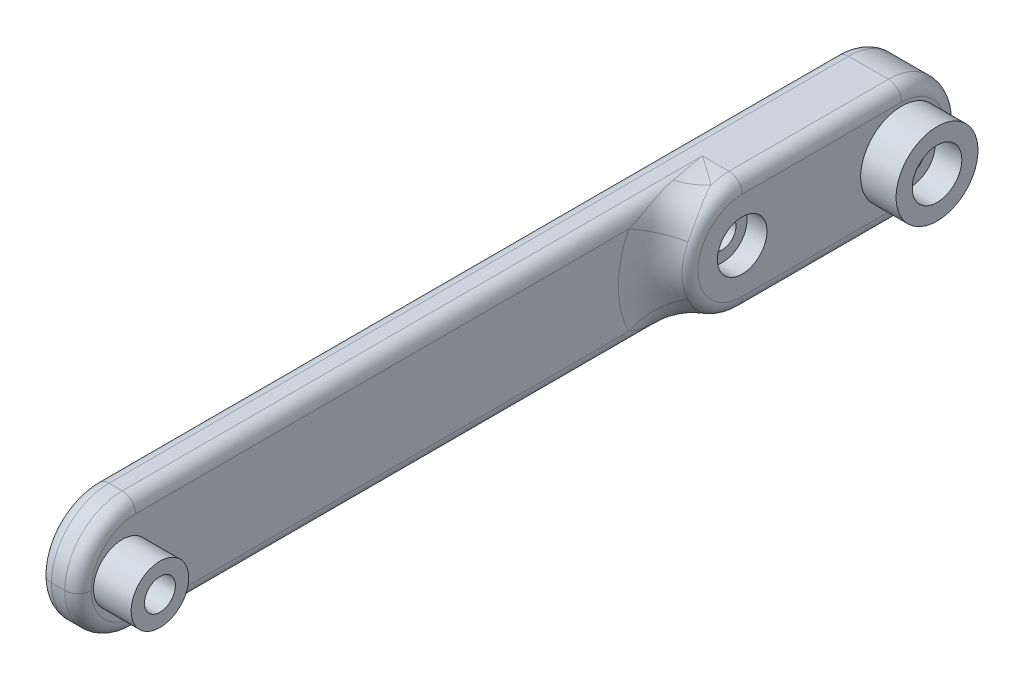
ISO-10303-21;
HEADER;
FILE_DESCRIPTION(('STEP AP214'),'2;1');
FILE_NAME('part.step','',(''),(''),'','','');
FILE_SCHEMA(('AUTOMOTIVE_DESIGN { 1 0 10303 214 1 1 1 1 }'));
ENDSEC;
DATA;
#1=APPLICATION_CONTEXT('core data for automotive mechanical design processes');
#2=APPLICATION_PROTOCOL_DEFINITION('international standard','automotive_design',2000,#1);
#3=PRODUCT_CONTEXT('',#1,'mechanical');
#4=PRODUCT('Part','Part','',(#3));
#5=PRODUCT_RELATED_PRODUCT_CATEGORY('part','',(#4));
#6=PRODUCT_DEFINITION_FORMATION('','',#4);
#7=PRODUCT_DEFINITION_CONTEXT('part definition',#1,'design');
#8=PRODUCT_DEFINITION('design','',#6,#7);
#9=PRODUCT_DEFINITION_SHAPE('','',#8);
#10=(LENGTH_UNIT() NAMED_UNIT(*) SI_UNIT(.MILLI.,.METRE.));
#11=(NAMED_UNIT(*) PLANE_ANGLE_UNIT() SI_UNIT($,.RADIAN.));
#12=(NAMED_UNIT(*) SI_UNIT($,.STERADIAN.) SOLID_ANGLE_UNIT());
#13=UNCERTAINTY_MEASURE_WITH_UNIT(LENGTH_MEASURE(1.E-05),#10,'distance_accuracy_value','');
#14=(GEOMETRIC_REPRESENTATION_CONTEXT(3) GLOBAL_UNCERTAINTY_ASSIGNED_CONTEXT((#13)) GLOBAL_UNIT_ASSIGNED_CONTEXT((#10,
#11,#12)) REPRESENTATION_CONTEXT('',''));
#15=CARTESIAN_POINT('',(0.,0.,0.));
#16=DIRECTION('',(0.,0.,1.));
#17=DIRECTION('',(1.,0.,0.));
#18=AXIS2_PLACEMENT_3D('',#15,#16,#17);
#19=CARTESIAN_POINT('',(4.5,0.,18.));
#20=DIRECTION('',(1.,0.,0.));
#21=DIRECTION('',(0.,0.,-1.));
#22=AXIS2_PLACEMENT_3D('',#19,#20,#21);
#23=CYLINDRICAL_SURFACE('',#22,6.5);
#24=CARTESIAN_POINT('',(6.,0.,18.));
#25=DIRECTION('',(1.,0.,0.));
#26=DIRECTION('',(0.,0.,-1.));
#27=AXIS2_PLACEMENT_3D('',#24,#25,#26);
#28=CIRCLE('',#27,6.5);
#29=CARTESIAN_POINT('',(6.,-6.5,18.));
#30=VERTEX_POINT('',#29);
#31=CARTESIAN_POINT('',(6.,-6.17440904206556,20.031421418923));
#32=VERTEX_POINT('',#31);
#33=EDGE_CURVE('E294',#30,#32,#28,.F.);
#34=ORIENTED_EDGE('',*,*,#33,.T.);
#35=CARTESIAN_POINT('',(8.7147887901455,-5.12567961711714,21.9971750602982));
#36=CARTESIAN_POINT('',(5.68845581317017,-4.15299719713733,23.2444705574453));
#37=CARTESIAN_POINT('',(4.1429577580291,-5.97141523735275,25.6868751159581));
#38=CARTESIAN_POINT('',(8.51746211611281,-5.24631332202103,21.8424297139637));
#39=CARTESIAN_POINT('',(5.66919054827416,-4.32430517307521,23.1023201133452));
#40=CARTESIAN_POINT('',(4.10349242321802,-6.01781281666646,25.3892879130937));
#41=CARTESIAN_POINT('',(8.31035319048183,-5.35823684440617,21.6845168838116));
#42=CARTESIAN_POINT('',(5.63007349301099,-4.49528952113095,22.9413443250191));
#43=CARTESIAN_POINT('',(4.06207063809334,-6.06086032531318,25.0856093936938));
#44=CARTESIAN_POINT('',(7.88055880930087,-5.56519676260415,21.3637877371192));
#45=CARTESIAN_POINT('',(5.51876083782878,-4.82354191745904,22.5920912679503));
#46=CARTESIAN_POINT('',(3.97611176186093,-6.14046029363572,24.4688225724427));
#47=CARTESIAN_POINT('',(7.65789326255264,-5.66025421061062,21.2009778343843));
#48=CARTESIAN_POINT('',(5.44715413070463,-4.98149835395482,22.4039946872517));
#49=CARTESIAN_POINT('',(3.93157865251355,-6.17702085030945,24.1557266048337));
#50=CARTESIAN_POINT('',(7.20102023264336,-5.83410152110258,20.8718951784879));
#51=CARTESIAN_POINT('',(5.27723219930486,-5.27696966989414,22.0066483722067));
#52=CARTESIAN_POINT('',(3.84020404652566,-6.24388520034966,23.522875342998));
#53=CARTESIAN_POINT('',(6.9668424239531,-5.91293074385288,20.7056319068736));
#54=CARTESIAN_POINT('',(5.17922797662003,-5.41527270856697,21.7973052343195));
#55=CARTESIAN_POINT('',(3.79336848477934,-6.27420413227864,23.2031382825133));
#56=CARTESIAN_POINT('',(6.48918426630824,-6.05521766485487,20.3701363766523));
#57=CARTESIAN_POINT('',(4.96245319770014,-5.66859244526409,21.3623273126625));
#58=CARTESIAN_POINT('',(3.69783685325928,-6.32892987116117,22.557954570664));
#59=CARTESIAN_POINT('',(6.24570097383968,-6.11867045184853,20.2009031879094));
#60=CARTESIAN_POINT('',(4.84367287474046,-5.78429131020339,21.1363149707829));
#61=CARTESIAN_POINT('',(3.64914019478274,-6.35333478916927,22.2325061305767));
#62=CARTESIAN_POINT('',(5.51788096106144,-6.28378047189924,19.6988611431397));
#63=CARTESIAN_POINT('',(4.47259211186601,-6.08596690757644,20.4562252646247));
#64=CARTESIAN_POINT('',(3.50357619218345,-6.41683864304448,21.2670406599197));
#65=CARTESIAN_POINT('',(5.02380734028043,-6.36471478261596,19.3629111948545));
#66=CARTESIAN_POINT('',(4.19537385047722,-6.24107379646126,19.9787123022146));
#67=CARTESIAN_POINT('',(3.40476146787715,-6.44796722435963,20.6209830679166));
#68=CARTESIAN_POINT('',(4.02422231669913,-6.47255260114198,18.6875927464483));
#69=CARTESIAN_POINT('',(3.61612096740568,-6.44643517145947,19.0076186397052));
#70=CARTESIAN_POINT('',(3.20484446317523,-6.48944330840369,19.3222937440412));
#71=CARTESIAN_POINT('',(3.51872379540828,-6.49951416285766,18.3482283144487));
#72=CARTESIAN_POINT('',(3.31124838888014,-6.4990637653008,18.5089728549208));
#73=CARTESIAN_POINT('',(3.10374475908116,-6.49981313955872,18.6696698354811));
#74=CARTESIAN_POINT('',(3.01141084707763,-6.49999566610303,18.007660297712));
#75=CARTESIAN_POINT('',(3.00684650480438,-6.4999916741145,18.0111958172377));
#76=CARTESIAN_POINT('',(3.00228216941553,-6.49999833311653,18.0147313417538));
#77=CARTESIAN_POINT('',(3.00912864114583,-6.49999729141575,18.0061282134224));
#78=CARTESIAN_POINT('',(3.00547718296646,-6.49999479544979,18.0089566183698));
#79=CARTESIAN_POINT('',(3.00182572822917,-6.49999895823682,18.0117850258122));
#80=CARTESIAN_POINT('',(3.0045642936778,-6.49999945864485,18.0030640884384));
#81=CARTESIAN_POINT('',(3.00273857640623,-6.49999895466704,18.0044782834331));
#82=CARTESIAN_POINT('',(3.00091285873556,-6.4999997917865,18.0058924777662));
#83=CARTESIAN_POINT('',(3.00228215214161,-6.50000000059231,18.0015320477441));
#84=CARTESIAN_POINT('',(3.0013692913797,-6.49999999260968,18.0022391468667));
#85=CARTESIAN_POINT('',(3.00045643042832,-6.50000000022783,18.0029462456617));
#86=CARTESIAN_POINT('',(3.,-6.5,18.));
#87=CARTESIAN_POINT('',(3.,-6.5,18.));
#88=CARTESIAN_POINT('',(3.,-6.5,18.));
#89=(BOUNDED_SURFACE() B_SPLINE_SURFACE(3,2,((#35,#36,#37),(#38,#39,#40),(#41,#42,#43),(#44,#45,
#46),(#47,#48,#49),(#50,#51,#52),(#53,#54,#55),(#56,#57,#58),(#59,#60,#61),(#62,#63,#64),(#65,
#66,#67),(#68,#69,#70),(#71,#72,#73),(#74,#75,#76),(#77,#78,#79),(#80,#81,#82),(#83,#84,#85),
(#86,#87,#88)),.UNSPECIFIED.,.F.,.F.,.F.) B_SPLINE_SURFACE_WITH_KNOTS((4,2,2,2,2,2,2,2,4),(3,3),
(0.,1.27645689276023,2.55130913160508,3.82303191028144,5.09516034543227,7.5719556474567,
10.0460854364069,10.0572659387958,10.06844612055),(0.,1.),
.UNSPECIFIED.) GEOMETRIC_REPRESENTATION_ITEM() RATIONAL_B_SPLINE_SURFACE(((1.,0.869103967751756,
1.),(1.,0.879592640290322,1.),(1.,0.889600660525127,1.),(1.,0.908489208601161,1.),(1.,
0.917371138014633,1.),(1.,0.933848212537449,1.),(1.,0.941446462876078,1.),(1.,0.955307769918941,
1.),(1.,0.961570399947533,1.),(1.,0.977981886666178,1.),(1.,0.986194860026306,1.),(1.,
0.997176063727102,1.),(1.,0.999950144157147,1.),(1.,0.999999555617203,1.),(1.,0.999999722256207,
1.),(1.,0.999999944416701,1.),(1.,0.999999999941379,1.),(1.,1.,1.))) REPRESENTATION_ITEM('') SURFACE());
#90=CARTESIAN_POINT('',(8.7147887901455,-5.12567961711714,21.9971750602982));
#91=CARTESIAN_POINT('',(8.51746211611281,-5.24631332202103,21.8424297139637));
#92=CARTESIAN_POINT('',(8.31035319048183,-5.35823684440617,21.6845168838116));
#93=CARTESIAN_POINT('',(7.88055880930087,-5.56519676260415,21.3637877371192));
#94=CARTESIAN_POINT('',(7.65789326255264,-5.66025421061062,21.2009778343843));
#95=CARTESIAN_POINT('',(7.20102023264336,-5.83410152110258,20.8718951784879));
#96=CARTESIAN_POINT('',(6.9668424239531,-5.91293074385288,20.7056319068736));
#97=CARTESIAN_POINT('',(6.48918426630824,-6.05521766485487,20.3701363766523));
#98=CARTESIAN_POINT('',(6.24570097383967,-6.11867045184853,20.2009031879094));
#99=CARTESIAN_POINT('',(5.51788096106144,-6.28378047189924,19.6988611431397));
#100=CARTESIAN_POINT('',(5.02380734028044,-6.36471478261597,19.3629111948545));
#101=CARTESIAN_POINT('',(4.02422231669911,-6.47255260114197,18.6875927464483));
#102=CARTESIAN_POINT('',(3.51872379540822,-6.49951416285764,18.3482283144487));
#103=CARTESIAN_POINT('',(3.01141084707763,-6.49999566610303,18.007660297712));
#104=CARTESIAN_POINT('',(3.00912864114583,-6.49999729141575,18.0061282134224));
#105=CARTESIAN_POINT('',(3.0045642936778,-6.49999945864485,18.0030640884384));
#106=CARTESIAN_POINT('',(3.00228215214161,-6.50000000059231,18.0015320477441));
#107=CARTESIAN_POINT('',(3.,-6.5,18.));
#108=B_SPLINE_CURVE_WITH_KNOTS('',3,(#90,#91,#92,#93,#94,#95,#96,#97,#98,#99,#100,#101,#102,
#103,#104,#105,#106,#107),.UNSPECIFIED.,.F.,.F.,(4,2,2,2,2,2,2,2,4),(0.,1.27645689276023,
2.55130913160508,3.82303191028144,5.09516034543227,7.5719556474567,10.0460854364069,
10.0572659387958,10.06844612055),.UNSPECIFIED.);
#109=CARTESIAN_POINT('',(3.,-6.5,18.));
#110=VERTEX_POINT('',#109);
#111=EDGE_CURVE('E454',#32,#110,#108,.T.);
#112=ORIENTED_EDGE('',*,*,#111,.T.);
#113=DIRECTION('',(1.,0.,0.));
#114=VECTOR('',#113,1.);
#115=CARTESIAN_POINT('',(4.5,-6.5,18.));
#116=LINE('',#115,#114);
#117=EDGE_CURVE('E262',#110,#30,#116,.T.);
#118=ORIENTED_EDGE('',*,*,#117,.T.);
#119=EDGE_LOOP('',(#34,#112,#118));
#120=FACE_BOUND('',#119,.T.);
#121=ADVANCED_FACE('F45',(#120),#23,.T.);
#122=CARTESIAN_POINT('',(4.5,0.,83.5));
#123=DIRECTION('',(-1.,0.,0.));
#124=DIRECTION('',(0.,0.,1.));
#125=AXIS2_PLACEMENT_3D('',#122,#123,#124);
#126=PLANE('',#125);
#127=DIRECTION('',(0.,0.,-1.));
#128=VECTOR('',#127,1.);
#129=CARTESIAN_POINT('',(4.5,-5.00000000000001,83.5));
#130=LINE('',#129,#128);
#131=CARTESIAN_POINT('',(4.5,-5.00000000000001,83.5));
#132=VERTEX_POINT('',#131);
#133=CARTESIAN_POINT('',(4.5,-5.,27.7979589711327));
#134=VERTEX_POINT('',#133);
#135=EDGE_CURVE('E322',#132,#134,#130,.T.);
#136=ORIENTED_EDGE('',*,*,#135,.T.);
#137=CARTESIAN_POINT('',(4.5,0.,18.));
#138=DIRECTION('',(-1.,0.,0.));
#139=DIRECTION('',(0.,0.,1.));
#140=AXIS2_PLACEMENT_3D('',#137,#138,#139);
#141=CIRCLE('',#140,11.);
#142=CARTESIAN_POINT('',(4.5,5.,27.7979589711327));
#143=VERTEX_POINT('',#142);
#144=EDGE_CURVE('E12',#134,#143,#141,.T.);
#145=ORIENTED_EDGE('',*,*,#144,.T.);
#146=DIRECTION('',(0.,0.,1.));
#147=VECTOR('',#146,1.);
#148=CARTESIAN_POINT('',(4.5,5.,83.5));
#149=LINE('',#148,#147);
#150=CARTESIAN_POINT('',(4.5,5.,83.5));
#151=VERTEX_POINT('',#150);
#152=EDGE_CURVE('E328',#143,#151,#149,.T.);
#153=ORIENTED_EDGE('',*,*,#152,.T.);
#154=CARTESIAN_POINT('',(4.5,0.,83.5));
#155=DIRECTION('',(-1.,0.,0.));
#156=DIRECTION('',(0.,0.,1.));
#157=AXIS2_PLACEMENT_3D('',#154,#155,#156);
#158=CIRCLE('',#157,5.);
#159=CARTESIAN_POINT('',(4.5,0.,88.5));
#160=VERTEX_POINT('',#159);
#161=EDGE_CURVE('E326',#151,#160,#158,.F.);
#162=ORIENTED_EDGE('',*,*,#161,.T.);
#163=CARTESIAN_POINT('',(4.5,0.,83.5));
#164=DIRECTION('',(-1.,0.,0.));
#165=DIRECTION('',(0.,0.,1.));
#166=AXIS2_PLACEMENT_3D('',#163,#164,#165);
#167=CIRCLE('',#166,5.);
#168=EDGE_CURVE('E324',#160,#132,#167,.F.);
#169=ORIENTED_EDGE('',*,*,#168,.T.);
#170=EDGE_LOOP('',(#136,#145,#153,#162,#169));
#171=FACE_BOUND('',#170,.T.);
#172=CARTESIAN_POINT('',(4.50000000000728,0.,85.));
#173=DIRECTION('',(-1.,0.,0.));
#174=DIRECTION('',(0.,0.,1.));
#175=AXIS2_PLACEMENT_3D('',#172,#173,#174);
#176=CIRCLE('',#175,3.25000000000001);
#177=CARTESIAN_POINT('',(4.50000000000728,0.,88.25));
#178=VERTEX_POINT('',#177);
#179=EDGE_CURVE('E265',#178,#178,#176,.F.);
#180=ORIENTED_EDGE('',*,*,#179,.F.);
#181=EDGE_LOOP('',(#180));
#182=FACE_BOUND('',#181,.T.);
#183=ADVANCED_FACE('F449',(#171,#182),#126,.F.);
#184=CARTESIAN_POINT('',(7.5,6.5,90.));
#185=DIRECTION('',(0.,-1.,0.));
#186=DIRECTION('',(0.,0.,-1.));
#187=AXIS2_PLACEMENT_3D('',#184,#185,#186);
#188=PLANE('',#187);
#189=DIRECTION('',(-1.,0.,0.));
#190=VECTOR('',#189,1.);
#191=CARTESIAN_POINT('',(7.5,6.5,0.));
#192=LINE('',#191,#190);
#193=CARTESIAN_POINT('',(6.,6.5,0.));
#194=VERTEX_POINT('',#193);
#195=CARTESIAN_POINT('',(1.5,6.5,0.));
#196=VERTEX_POINT('',#195);
#197=EDGE_CURVE('E269',#194,#196,#192,.T.);
#198=ORIENTED_EDGE('',*,*,#197,.T.);
#199=DIRECTION('',(0.,0.,1.));
#200=VECTOR('',#199,1.);
#201=CARTESIAN_POINT('',(1.5,6.5,90.));
#202=LINE('',#201,#200);
#203=CARTESIAN_POINT('',(1.5,6.5,83.5));
#204=VERTEX_POINT('',#203);
#205=EDGE_CURVE('E320',#196,#204,#202,.T.);
#206=ORIENTED_EDGE('',*,*,#205,.T.);
#207=DIRECTION('',(-1.,0.,0.));
#208=VECTOR('',#207,1.);
#209=CARTESIAN_POINT('',(7.5,6.5,83.5));
#210=LINE('',#209,#208);
#211=CARTESIAN_POINT('',(3.,6.5,83.5));
#212=VERTEX_POINT('',#211);
#213=EDGE_CURVE('E245',#204,#212,#210,.F.);
#214=ORIENTED_EDGE('',*,*,#213,.T.);
#215=DIRECTION('',(0.,0.,1.));
#216=VECTOR('',#215,1.);
#217=CARTESIAN_POINT('',(3.,6.5,90.));
#218=LINE('',#217,#216);
#219=CARTESIAN_POINT('',(3.,6.5,18.));
#220=VERTEX_POINT('',#219);
#221=EDGE_CURVE('E317',#212,#220,#218,.F.);
#222=ORIENTED_EDGE('',*,*,#221,.T.);
#223=DIRECTION('',(1.,0.,0.));
#224=VECTOR('',#223,1.);
#225=CARTESIAN_POINT('',(4.5,6.5,18.));
#226=LINE('',#225,#224);
#227=CARTESIAN_POINT('',(6.,6.5,18.));
#228=VERTEX_POINT('',#227);
#229=EDGE_CURVE('E266',#220,#228,#226,.T.);
#230=ORIENTED_EDGE('',*,*,#229,.T.);
#231=DIRECTION('',(0.,0.,1.));
#232=VECTOR('',#231,1.);
#233=CARTESIAN_POINT('',(6.,6.5,0.));
#234=LINE('',#233,#232);
#235=EDGE_CURVE('E315',#228,#194,#234,.F.);
#236=ORIENTED_EDGE('',*,*,#235,.T.);
#237=EDGE_LOOP('',(#198,#206,#214,#222,#230,#236));
#238=FACE_BOUND('',#237,.T.);
#239=ADVANCED_FACE('F567',(#238),#188,.F.);
#240=CARTESIAN_POINT('',(8.75,0.,18.));
#241=DIRECTION('',(-1.,0.,0.));
#242=DIRECTION('',(0.,0.,1.));
#243=AXIS2_PLACEMENT_3D('',#240,#241,#242);
#244=CYLINDRICAL_SURFACE('',#243,1.55);
#245=CARTESIAN_POINT('',(4.25,0.,18.));
#246=DIRECTION('',(-1.,0.,0.));
#247=DIRECTION('',(0.,0.,1.));
#248=AXIS2_PLACEMENT_3D('',#245,#246,#247);
#249=CIRCLE('',#248,1.55);
#250=CARTESIAN_POINT('',(4.25,0.,19.55));
#251=VERTEX_POINT('',#250);
#252=EDGE_CURVE('E241',#251,#251,#249,.T.);
#253=ORIENTED_EDGE('',*,*,#252,.T.);
#254=EDGE_LOOP('',(#253));
#255=FACE_BOUND('',#254,.T.);
#256=CARTESIAN_POINT('',(5.25,0.,18.));
#257=DIRECTION('',(1.,0.,0.));
#258=DIRECTION('',(0.,0.,-1.));
#259=AXIS2_PLACEMENT_3D('',#256,#257,#258);
#260=CIRCLE('',#259,1.55);
#261=CARTESIAN_POINT('',(5.25,0.,16.45));
#262=VERTEX_POINT('',#261);
#263=EDGE_CURVE('E250',#262,#262,#260,.F.);
#264=ORIENTED_EDGE('',*,*,#263,.F.);
#265=EDGE_LOOP('',(#264));
#266=FACE_BOUND('',#265,.T.);
#267=ADVANCED_FACE('F571',(#255,#266),#244,.F.);
#268=CARTESIAN_POINT('',(7.5,0.,85.));
#269=DIRECTION('',(-1.,0.,0.));
#270=DIRECTION('',(0.,0.,1.));
#271=AXIS2_PLACEMENT_3D('',#268,#269,#270);
#272=CYLINDRICAL_SURFACE('',#271,1.75);
#273=CARTESIAN_POINT('',(2.,0.,85.));
#274=DIRECTION('',(-1.,0.,0.));
#275=DIRECTION('',(0.,0.,1.));
#276=AXIS2_PLACEMENT_3D('',#273,#274,#275);
#277=CIRCLE('',#276,1.75);
#278=CARTESIAN_POINT('',(2.,0.,86.75));
#279=VERTEX_POINT('',#278);
#280=EDGE_CURVE('E244',#279,#279,#277,.T.);
#281=ORIENTED_EDGE('',*,*,#280,.T.);
#282=EDGE_LOOP('',(#281));
#283=FACE_BOUND('',#282,.T.);
#284=CARTESIAN_POINT('',(8.75,0.,85.));
#285=DIRECTION('',(1.,0.,0.));
#286=DIRECTION('',(0.,0.,-1.));
#287=AXIS2_PLACEMENT_3D('',#284,#285,#286);
#288=CIRCLE('',#287,1.75);
#289=CARTESIAN_POINT('',(8.75,0.,83.25));
#290=VERTEX_POINT('',#289);
#291=EDGE_CURVE('E342',#290,#290,#288,.F.);
#292=ORIENTED_EDGE('',*,*,#291,.F.);
#293=EDGE_LOOP('',(#292));
#294=FACE_BOUND('',#293,.T.);
#295=ADVANCED_FACE('F623',(#283,#294),#272,.F.);
#296=CARTESIAN_POINT('',(7.5,0.,0.));
#297=DIRECTION('',(1.,0.,0.));
#298=DIRECTION('',(0.,0.,-1.));
#299=AXIS2_PLACEMENT_3D('',#296,#297,#298);
#300=PLANE('',#299);
#301=DIRECTION('',(0.,0.,-1.));
#302=VECTOR('',#301,1.);
#303=CARTESIAN_POINT('',(7.5,-5.,0.));
#304=LINE('',#303,#302);
#305=CARTESIAN_POINT('',(7.5,-5.,18.));
#306=VERTEX_POINT('',#305);
#307=CARTESIAN_POINT('',(7.5,-5.,0.));
#308=VERTEX_POINT('',#307);
#309=EDGE_CURVE('E277',#306,#308,#304,.T.);
#310=ORIENTED_EDGE('',*,*,#309,.T.);
#311=CARTESIAN_POINT('',(7.5,0.,0.));
#312=DIRECTION('',(1.,0.,0.));
#313=DIRECTION('',(0.,0.,-1.));
#314=AXIS2_PLACEMENT_3D('',#311,#312,#313);
#315=CIRCLE('',#314,5.);
#316=CARTESIAN_POINT('',(7.5,5.,0.));
#317=VERTEX_POINT('',#316);
#318=EDGE_CURVE('E279',#308,#317,#315,.T.);
#319=ORIENTED_EDGE('',*,*,#318,.T.);
#320=DIRECTION('',(0.,0.,1.));
#321=VECTOR('',#320,1.);
#322=CARTESIAN_POINT('',(7.5,5.,18.));
#323=LINE('',#322,#321);
#324=CARTESIAN_POINT('',(7.5,5.,18.));
#325=VERTEX_POINT('',#324);
#326=EDGE_CURVE('E273',#317,#325,#323,.T.);
#327=ORIENTED_EDGE('',*,*,#326,.T.);
#328=CARTESIAN_POINT('',(7.5,0.,18.));
#329=DIRECTION('',(1.,0.,0.));
#330=DIRECTION('',(0.,0.,-1.));
#331=AXIS2_PLACEMENT_3D('',#328,#329,#330);
#332=CIRCLE('',#331,5.);
#333=EDGE_CURVE('E275',#325,#306,#332,.T.);
#334=ORIENTED_EDGE('',*,*,#333,.T.);
#335=EDGE_LOOP('',(#310,#319,#327,#334));
#336=FACE_BOUND('',#335,.T.);
#337=CARTESIAN_POINT('',(7.5,0.,0.));
#338=DIRECTION('',(1.,0.,0.));
#339=DIRECTION('',(0.,0.,-1.));
#340=AXIS2_PLACEMENT_3D('',#337,#338,#339);
#341=CIRCLE('',#340,4.625);
#342=CARTESIAN_POINT('',(7.5,0.,-4.625));
#343=VERTEX_POINT('',#342);
#344=EDGE_CURVE('E253',#343,#343,#341,.T.);
#345=ORIENTED_EDGE('',*,*,#344,.F.);
#346=EDGE_LOOP('',(#345));
#347=FACE_BOUND('',#346,.T.);
#348=CARTESIAN_POINT('',(7.5,0.,18.));
#349=DIRECTION('',(1.,0.,0.));
#350=DIRECTION('',(0.,0.,-1.));
#351=AXIS2_PLACEMENT_3D('',#348,#349,#350);
#352=CIRCLE('',#351,2.8);
#353=CARTESIAN_POINT('',(7.5,0.,15.2));
#354=VERTEX_POINT('',#353);
#355=EDGE_CURVE('E246',#354,#354,#352,.T.);
#356=ORIENTED_EDGE('',*,*,#355,.F.);
#357=EDGE_LOOP('',(#356));
#358=FACE_BOUND('',#357,.T.);
#359=ADVANCED_FACE('F615',(#336,#347,#358),#300,.T.);
#360=CARTESIAN_POINT('',(0.,0.,0.));
#361=DIRECTION('',(1.,0.,0.));
#362=DIRECTION('',(0.,0.,-1.));
#363=AXIS2_PLACEMENT_3D('',#360,#361,#362);
#364=PLANE('',#363);
#365=CARTESIAN_POINT('',(0.,0.,85.));
#366=DIRECTION('',(-1.,0.,0.));
#367=DIRECTION('',(0.,0.,1.));
#368=AXIS2_PLACEMENT_3D('',#365,#366,#367);
#369=CIRCLE('',#368,3.00000000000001);
#370=CARTESIAN_POINT('',(0.,0.,88.));
#371=VERTEX_POINT('',#370);
#372=EDGE_CURVE('E591',#371,#371,#369,.T.);
#373=ORIENTED_EDGE('',*,*,#372,.F.);
#374=EDGE_LOOP('',(#373));
#375=FACE_BOUND('',#374,.T.);
#376=CARTESIAN_POINT('',(0.,0.,83.5));
#377=DIRECTION('',(1.,0.,0.));
#378=DIRECTION('',(0.,0.,-1.));
#379=AXIS2_PLACEMENT_3D('',#376,#377,#378);
#380=CIRCLE('',#379,5.);
#381=CARTESIAN_POINT('',(0.,0.,88.5));
#382=VERTEX_POINT('',#381);
#383=CARTESIAN_POINT('',(0.,5.,83.5));
#384=VERTEX_POINT('',#383);
#385=EDGE_CURVE('E302',#382,#384,#380,.F.);
#386=ORIENTED_EDGE('',*,*,#385,.T.);
#387=DIRECTION('',(0.,0.,1.));
#388=VECTOR('',#387,1.);
#389=CARTESIAN_POINT('',(0.,5.,0.));
#390=LINE('',#389,#388);
#391=CARTESIAN_POINT('',(0.,5.,0.));
#392=VERTEX_POINT('',#391);
#393=EDGE_CURVE('E304',#384,#392,#390,.F.);
#394=ORIENTED_EDGE('',*,*,#393,.T.);
#395=CARTESIAN_POINT('',(0.,0.,0.));
#396=DIRECTION('',(1.,0.,0.));
#397=DIRECTION('',(0.,0.,-1.));
#398=AXIS2_PLACEMENT_3D('',#395,#396,#397);
#399=CIRCLE('',#398,5.);
#400=CARTESIAN_POINT('',(0.,4.90636346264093,0.963118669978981));
#401=VERTEX_POINT('',#400);
#402=EDGE_CURVE('E211',#392,#401,#399,.T.);
#403=ORIENTED_EDGE('',*,*,#402,.T.);
#404=DIRECTION('',(0.,-0.0967659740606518,0.995307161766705));
#405=VECTOR('',#404,1.);
#406=CARTESIAN_POINT('',(0.,4.95318173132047,0.48155933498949));
#407=LINE('',#406,#405);
#408=CARTESIAN_POINT('',(0.,3.25,18.));
#409=VERTEX_POINT('',#408);
#410=EDGE_CURVE('E209',#401,#409,#407,.T.);
#411=ORIENTED_EDGE('',*,*,#410,.T.);
#412=CARTESIAN_POINT('',(0.,0.,18.));
#413=DIRECTION('',(1.,0.,0.));
#414=DIRECTION('',(0.,0.,-1.));
#415=AXIS2_PLACEMENT_3D('',#412,#413,#414);
#416=CIRCLE('',#415,3.25);
#417=CARTESIAN_POINT('',(0.,-3.25,18.));
#418=VERTEX_POINT('',#417);
#419=EDGE_CURVE('E215',#409,#418,#416,.T.);
#420=ORIENTED_EDGE('',*,*,#419,.T.);
#421=DIRECTION('',(0.,-0.0967659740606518,-0.995307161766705));
#422=VECTOR('',#421,1.);
#423=CARTESIAN_POINT('',(0.,-4.95318173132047,0.48155933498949));
#424=LINE('',#423,#422);
#425=CARTESIAN_POINT('',(0.,-4.90636346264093,0.963118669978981));
#426=VERTEX_POINT('',#425);
#427=EDGE_CURVE('E191',#418,#426,#424,.T.);
#428=ORIENTED_EDGE('',*,*,#427,.T.);
#429=CARTESIAN_POINT('',(0.,-5.,0.));
#430=VERTEX_POINT('',#429);
#431=EDGE_CURVE('E202',#426,#430,#399,.T.);
#432=ORIENTED_EDGE('',*,*,#431,.T.);
#433=DIRECTION('',(0.,0.,-1.));
#434=VECTOR('',#433,1.);
#435=CARTESIAN_POINT('',(0.,-5.,0.));
#436=LINE('',#435,#434);
#437=CARTESIAN_POINT('',(0.,-5.00000000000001,83.5));
#438=VERTEX_POINT('',#437);
#439=EDGE_CURVE('E297',#430,#438,#436,.F.);
#440=ORIENTED_EDGE('',*,*,#439,.T.);
#441=CARTESIAN_POINT('',(0.,0.,83.5));
#442=DIRECTION('',(1.,0.,0.));
#443=DIRECTION('',(0.,0.,-1.));
#444=AXIS2_PLACEMENT_3D('',#441,#442,#443);
#445=CIRCLE('',#444,5.);
#446=EDGE_CURVE('E299',#438,#382,#445,.F.);
#447=ORIENTED_EDGE('',*,*,#446,.T.);
#448=EDGE_LOOP('',(#386,#394,#403,#411,#420,#428,#432,#440,#447));
#449=FACE_BOUND('',#448,.T.);
#450=ADVANCED_FACE('F213',(#375,#449),#364,.F.);
#451=CARTESIAN_POINT('',(7.5,0.,0.));
#452=DIRECTION('',(-1.,0.,0.));
#453=DIRECTION('',(0.,0.,1.));
#454=AXIS2_PLACEMENT_3D('',#451,#452,#453);
#455=CYLINDRICAL_SURFACE('',#454,6.5);
#456=ORIENTED_EDGE('',*,*,#197,.F.);
#457=CARTESIAN_POINT('',(6.,0.,0.));
#458=DIRECTION('',(1.,0.,0.));
#459=DIRECTION('',(0.,0.,-1.));
#460=AXIS2_PLACEMENT_3D('',#457,#458,#459);
#461=CIRCLE('',#460,6.5);
#462=CARTESIAN_POINT('',(6.,-6.5,0.));
#463=VERTEX_POINT('',#462);
#464=EDGE_CURVE('E284',#194,#463,#461,.F.);
#465=ORIENTED_EDGE('',*,*,#464,.T.);
#466=DIRECTION('',(-1.,0.,0.));
#467=VECTOR('',#466,1.);
#468=CARTESIAN_POINT('',(7.5,-6.5,0.));
#469=LINE('',#468,#467);
#470=CARTESIAN_POINT('',(1.5,-6.5,0.));
#471=VERTEX_POINT('',#470);
#472=EDGE_CURVE('E216',#463,#471,#469,.T.);
#473=ORIENTED_EDGE('',*,*,#472,.T.);
#474=CARTESIAN_POINT('',(1.5,0.,0.));
#475=DIRECTION('',(1.,0.,0.));
#476=DIRECTION('',(0.,0.,-1.));
#477=AXIS2_PLACEMENT_3D('',#474,#475,#476);
#478=CIRCLE('',#477,6.5);
#479=EDGE_CURVE('E282',#471,#196,#478,.T.);
#480=ORIENTED_EDGE('',*,*,#479,.T.);
#481=EDGE_LOOP('',(#456,#465,#473,#480));
#482=FACE_BOUND('',#481,.T.);
#483=ADVANCED_FACE('F614',(#482),#455,.T.);
#484=CARTESIAN_POINT('',(7.5,-6.5,0.));
#485=DIRECTION('',(0.,1.,0.));
#486=DIRECTION('',(0.,0.,1.));
#487=AXIS2_PLACEMENT_3D('',#484,#485,#486);
#488=PLANE('',#487);
#489=ORIENTED_EDGE('',*,*,#472,.F.);
#490=DIRECTION('',(0.,0.,-1.));
#491=VECTOR('',#490,1.);
#492=CARTESIAN_POINT('',(6.,-6.5,18.));
#493=LINE('',#492,#491);
#494=EDGE_CURVE('E291',#463,#30,#493,.F.);
#495=ORIENTED_EDGE('',*,*,#494,.T.);
#496=ORIENTED_EDGE('',*,*,#117,.F.);
#497=DIRECTION('',(0.,0.,-1.));
#498=VECTOR('',#497,1.);
#499=CARTESIAN_POINT('',(3.,-6.5,0.));
#500=LINE('',#499,#498);
#501=CARTESIAN_POINT('',(3.,-6.50000000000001,83.5));
#502=VERTEX_POINT('',#501);
#503=EDGE_CURVE('E287',#110,#502,#500,.F.);
#504=ORIENTED_EDGE('',*,*,#503,.T.);
#505=DIRECTION('',(-1.,0.,0.));
#506=VECTOR('',#505,1.);
#507=CARTESIAN_POINT('',(7.5,-6.50000000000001,83.5));
#508=LINE('',#507,#506);
#509=CARTESIAN_POINT('',(1.5,-6.50000000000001,83.5));
#510=VERTEX_POINT('',#509);
#511=EDGE_CURVE('E219',#502,#510,#508,.T.);
#512=ORIENTED_EDGE('',*,*,#511,.T.);
#513=DIRECTION('',(0.,0.,-1.));
#514=VECTOR('',#513,1.);
#515=CARTESIAN_POINT('',(1.5,-6.5,0.));
#516=LINE('',#515,#514);
#517=EDGE_CURVE('E289',#510,#471,#516,.T.);
#518=ORIENTED_EDGE('',*,*,#517,.T.);
#519=EDGE_LOOP('',(#489,#495,#496,#504,#512,#518));
#520=FACE_BOUND('',#519,.T.);
#521=ADVANCED_FACE('F546',(#520),#488,.F.);
#522=CARTESIAN_POINT('',(2.,0.,85.));
#523=DIRECTION('',(-1.,0.,0.));
#524=DIRECTION('',(0.,0.,1.));
#525=AXIS2_PLACEMENT_3D('',#522,#523,#524);
#526=CYLINDRICAL_SURFACE('',#525,3.00000000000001);
#527=CARTESIAN_POINT('',(2.,0.,85.));
#528=DIRECTION('',(-1.,0.,0.));
#529=DIRECTION('',(0.,0.,1.));
#530=AXIS2_PLACEMENT_3D('',#527,#528,#529);
#531=CIRCLE('',#530,3.00000000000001);
#532=CARTESIAN_POINT('',(2.,0.,88.));
#533=VERTEX_POINT('',#532);
#534=EDGE_CURVE('E227',#533,#533,#531,.T.);
#535=ORIENTED_EDGE('',*,*,#534,.F.);
#536=EDGE_LOOP('',(#535));
#537=FACE_BOUND('',#536,.T.);
#538=ORIENTED_EDGE('',*,*,#372,.T.);
#539=EDGE_LOOP('',(#538));
#540=FACE_BOUND('',#539,.T.);
#541=ADVANCED_FACE('F607',(#537,#540),#526,.F.);
#542=CARTESIAN_POINT('',(2.,0.,85.));
#543=DIRECTION('',(-1.,0.,0.));
#544=DIRECTION('',(0.,0.,1.));
#545=AXIS2_PLACEMENT_3D('',#542,#543,#544);
#546=PLANE('',#545);
#547=ORIENTED_EDGE('',*,*,#280,.F.);
#548=EDGE_LOOP('',(#547));
#549=FACE_BOUND('',#548,.T.);
#550=ORIENTED_EDGE('',*,*,#534,.T.);
#551=EDGE_LOOP('',(#550));
#552=FACE_BOUND('',#551,.T.);
#553=ADVANCED_FACE('F605',(#549,#552),#546,.T.);
#554=CARTESIAN_POINT('',(4.25,0.,18.));
#555=DIRECTION('',(-1.,0.,0.));
#556=DIRECTION('',(0.,0.,1.));
#557=AXIS2_PLACEMENT_3D('',#554,#555,#556);
#558=CYLINDRICAL_SURFACE('',#557,3.25);
#559=DIRECTION('',(-1.,0.,0.));
#560=VECTOR('',#559,1.);
#561=CARTESIAN_POINT('',(4.25,3.25,18.));
#562=LINE('',#561,#560);
#563=CARTESIAN_POINT('',(4.25,3.25,18.));
#564=VERTEX_POINT('',#563);
#565=EDGE_CURVE('E199',#564,#409,#562,.T.);
#566=ORIENTED_EDGE('',*,*,#565,.F.);
#567=CARTESIAN_POINT('',(4.25,0.,18.));
#568=DIRECTION('',(-1.,0.,0.));
#569=DIRECTION('',(0.,0.,1.));
#570=AXIS2_PLACEMENT_3D('',#567,#568,#569);
#571=CIRCLE('',#570,3.25);
#572=CARTESIAN_POINT('',(4.25,-3.25,18.));
#573=VERTEX_POINT('',#572);
#574=EDGE_CURVE('E236',#573,#564,#571,.T.);
#575=ORIENTED_EDGE('',*,*,#574,.F.);
#576=DIRECTION('',(-1.,0.,0.));
#577=VECTOR('',#576,1.);
#578=CARTESIAN_POINT('',(4.25,-3.25,18.));
#579=LINE('',#578,#577);
#580=EDGE_CURVE('E224',#573,#418,#579,.T.);
#581=ORIENTED_EDGE('',*,*,#580,.T.);
#582=ORIENTED_EDGE('',*,*,#419,.F.);
#583=EDGE_LOOP('',(#566,#575,#581,#582));
#584=FACE_BOUND('',#583,.T.);
#585=ADVANCED_FACE('F630',(#584),#558,.F.);
#586=CARTESIAN_POINT('',(4.25,0.,0.));
#587=DIRECTION('',(-1.,0.,0.));
#588=DIRECTION('',(0.,0.,1.));
#589=AXIS2_PLACEMENT_3D('',#586,#587,#588);
#590=CYLINDRICAL_SURFACE('',#589,5.);
#591=DIRECTION('',(-1.,0.,0.));
#592=VECTOR('',#591,1.);
#593=CARTESIAN_POINT('',(4.25,-4.90636346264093,0.963118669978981));
#594=LINE('',#593,#592);
#595=CARTESIAN_POINT('',(4.25,-4.90636346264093,0.963118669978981));
#596=VERTEX_POINT('',#595);
#597=EDGE_CURVE('E187',#596,#426,#594,.T.);
#598=ORIENTED_EDGE('',*,*,#597,.F.);
#599=CARTESIAN_POINT('',(4.25,0.,0.));
#600=DIRECTION('',(-1.,0.,0.));
#601=DIRECTION('',(0.,0.,1.));
#602=AXIS2_PLACEMENT_3D('',#599,#600,#601);
#603=CIRCLE('',#602,5.);
#604=CARTESIAN_POINT('',(4.25,4.90636346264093,0.963118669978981));
#605=VERTEX_POINT('',#604);
#606=EDGE_CURVE('E198',#605,#596,#603,.T.);
#607=ORIENTED_EDGE('',*,*,#606,.F.);
#608=DIRECTION('',(-1.,0.,0.));
#609=VECTOR('',#608,1.);
#610=CARTESIAN_POINT('',(4.25,4.90636346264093,0.963118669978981));
#611=LINE('',#610,#609);
#612=EDGE_CURVE('E226',#605,#401,#611,.T.);
#613=ORIENTED_EDGE('',*,*,#612,.T.);
#614=ORIENTED_EDGE('',*,*,#402,.F.);
#615=EDGE_CURVE('E206',#430,#392,#399,.T.);
#616=ORIENTED_EDGE('',*,*,#615,.F.);
#617=ORIENTED_EDGE('',*,*,#431,.F.);
#618=EDGE_LOOP('',(#598,#607,#613,#614,#616,#617));
#619=FACE_BOUND('',#618,.T.);
#620=ADVANCED_FACE('F203',(#619),#590,.F.);
#621=CARTESIAN_POINT('',(4.25,4.90636346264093,0.963118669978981));
#622=DIRECTION('',(0.,0.995307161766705,0.0967659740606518));
#623=DIRECTION('',(0.,-0.0967659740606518,0.995307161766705));
#624=AXIS2_PLACEMENT_3D('',#621,#622,#623);
#625=PLANE('',#624);
#626=ORIENTED_EDGE('',*,*,#612,.F.);
#627=DIRECTION('',(0.,0.0967659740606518,-0.995307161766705));
#628=VECTOR('',#627,1.);
#629=CARTESIAN_POINT('',(4.25,4.90636346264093,0.963118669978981));
#630=LINE('',#629,#628);
#631=EDGE_CURVE('E232',#564,#605,#630,.T.);
#632=ORIENTED_EDGE('',*,*,#631,.F.);
#633=ORIENTED_EDGE('',*,*,#565,.T.);
#634=ORIENTED_EDGE('',*,*,#410,.F.);
#635=EDGE_LOOP('',(#626,#632,#633,#634));
#636=FACE_BOUND('',#635,.T.);
#637=ADVANCED_FACE('F634',(#636),#625,.F.);
#638=CARTESIAN_POINT('',(4.25,-4.90636346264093,0.963118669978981));
#639=DIRECTION('',(0.,-0.995307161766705,0.0967659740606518));
#640=DIRECTION('',(0.,-0.0967659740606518,-0.995307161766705));
#641=AXIS2_PLACEMENT_3D('',#638,#639,#640);
#642=PLANE('',#641);
#643=ORIENTED_EDGE('',*,*,#580,.F.);
#644=DIRECTION('',(0.,0.0967659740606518,0.995307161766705));
#645=VECTOR('',#644,1.);
#646=CARTESIAN_POINT('',(4.25,-4.90636346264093,0.963118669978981));
#647=LINE('',#646,#645);
#648=EDGE_CURVE('E194',#596,#573,#647,.T.);
#649=ORIENTED_EDGE('',*,*,#648,.F.);
#650=ORIENTED_EDGE('',*,*,#597,.T.);
#651=ORIENTED_EDGE('',*,*,#427,.F.);
#652=EDGE_LOOP('',(#643,#649,#650,#651));
#653=FACE_BOUND('',#652,.T.);
#654=ADVANCED_FACE('F189',(#653),#642,.F.);
#655=CARTESIAN_POINT('',(4.25,0.,0.));
#656=DIRECTION('',(-1.,0.,0.));
#657=DIRECTION('',(0.,0.,1.));
#658=AXIS2_PLACEMENT_3D('',#655,#656,#657);
#659=PLANE('',#658);
#660=CARTESIAN_POINT('',(4.25,0.,0.));
#661=DIRECTION('',(-1.,0.,0.));
#662=DIRECTION('',(0.,0.,1.));
#663=AXIS2_PLACEMENT_3D('',#660,#661,#662);
#664=CIRCLE('',#663,1.55);
#665=CARTESIAN_POINT('',(4.25,0.,1.55));
#666=VERTEX_POINT('',#665);
#667=EDGE_CURVE('E49',#666,#666,#664,.T.);
#668=ORIENTED_EDGE('',*,*,#667,.F.);
#669=EDGE_LOOP('',(#668));
#670=FACE_BOUND('',#669,.T.);
#671=ORIENTED_EDGE('',*,*,#252,.F.);
#672=EDGE_LOOP('',(#671));
#673=FACE_BOUND('',#672,.T.);
#674=ORIENTED_EDGE('',*,*,#606,.T.);
#675=ORIENTED_EDGE('',*,*,#648,.T.);
#676=ORIENTED_EDGE('',*,*,#574,.T.);
#677=ORIENTED_EDGE('',*,*,#631,.T.);
#678=EDGE_LOOP('',(#674,#675,#676,#677));
#679=FACE_BOUND('',#678,.T.);
#680=ADVANCED_FACE('F637',(#670,#673,#679),#659,.T.);
#681=CARTESIAN_POINT('',(5.25,0.,18.));
#682=DIRECTION('',(1.,0.,0.));
#683=DIRECTION('',(0.,0.,-1.));
#684=AXIS2_PLACEMENT_3D('',#681,#682,#683);
#685=PLANE('',#684);
#686=CARTESIAN_POINT('',(5.25,0.,18.));
#687=DIRECTION('',(1.,0.,0.));
#688=DIRECTION('',(0.,0.,-1.));
#689=AXIS2_PLACEMENT_3D('',#686,#687,#688);
#690=CIRCLE('',#689,2.8);
#691=CARTESIAN_POINT('',(5.25,0.,15.2));
#692=VERTEX_POINT('',#691);
#693=EDGE_CURVE('E235',#692,#692,#690,.T.);
#694=ORIENTED_EDGE('',*,*,#693,.T.);
#695=EDGE_LOOP('',(#694));
#696=FACE_BOUND('',#695,.T.);
#697=ORIENTED_EDGE('',*,*,#263,.T.);
#698=EDGE_LOOP('',(#697));
#699=FACE_BOUND('',#698,.T.);
#700=ADVANCED_FACE('F645',(#696,#699),#685,.T.);
#701=CARTESIAN_POINT('',(5.25,0.,18.));
#702=DIRECTION('',(1.,0.,0.));
#703=DIRECTION('',(0.,0.,-1.));
#704=AXIS2_PLACEMENT_3D('',#701,#702,#703);
#705=CYLINDRICAL_SURFACE('',#704,2.8);
#706=ORIENTED_EDGE('',*,*,#693,.F.);
#707=EDGE_LOOP('',(#706));
#708=FACE_BOUND('',#707,.T.);
#709=ORIENTED_EDGE('',*,*,#355,.T.);
#710=EDGE_LOOP('',(#709));
#711=FACE_BOUND('',#710,.T.);
#712=ADVANCED_FACE('F650',(#708,#711),#705,.F.);
#713=CARTESIAN_POINT('',(11.5,0.,0.));
#714=DIRECTION('',(1.,0.,0.));
#715=DIRECTION('',(0.,0.,-1.));
#716=AXIS2_PLACEMENT_3D('',#713,#714,#715);
#717=PLANE('',#716);
#718=CARTESIAN_POINT('',(11.5,0.,0.));
#719=DIRECTION('',(1.,0.,0.));
#720=DIRECTION('',(0.,0.,-1.));
#721=AXIS2_PLACEMENT_3D('',#718,#719,#720);
#722=CIRCLE('',#721,2.8);
#723=CARTESIAN_POINT('',(11.5,0.,-2.8));
#724=VERTEX_POINT('',#723);
#725=EDGE_CURVE('E256',#724,#724,#722,.T.);
#726=ORIENTED_EDGE('',*,*,#725,.F.);
#727=EDGE_LOOP('',(#726));
#728=FACE_BOUND('',#727,.T.);
#729=CARTESIAN_POINT('',(11.5,0.,0.));
#730=DIRECTION('',(1.,0.,0.));
#731=DIRECTION('',(0.,0.,-1.));
#732=AXIS2_PLACEMENT_3D('',#729,#730,#731);
#733=CIRCLE('',#732,4.625);
#734=CARTESIAN_POINT('',(11.5,0.,-4.625));
#735=VERTEX_POINT('',#734);
#736=EDGE_CURVE('E249',#735,#735,#733,.T.);
#737=ORIENTED_EDGE('',*,*,#736,.T.);
#738=EDGE_LOOP('',(#737));
#739=FACE_BOUND('',#738,.T.);
#740=ADVANCED_FACE('F653',(#728,#739),#717,.T.);
#741=CARTESIAN_POINT('',(11.5,0.,0.));
#742=DIRECTION('',(-1.,0.,0.));
#743=DIRECTION('',(0.,0.,1.));
#744=AXIS2_PLACEMENT_3D('',#741,#742,#743);
#745=CYLINDRICAL_SURFACE('',#744,4.625);
#746=ORIENTED_EDGE('',*,*,#736,.F.);
#747=EDGE_LOOP('',(#746));
#748=FACE_BOUND('',#747,.T.);
#749=ORIENTED_EDGE('',*,*,#344,.T.);
#750=EDGE_LOOP('',(#749));
#751=FACE_BOUND('',#750,.T.);
#752=ADVANCED_FACE('F658',(#748,#751),#745,.T.);
#753=CARTESIAN_POINT('',(0.999999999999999,0.,0.));
#754=DIRECTION('',(1.,0.,0.));
#755=DIRECTION('',(0.,0.,-1.));
#756=AXIS2_PLACEMENT_3D('',#753,#754,#755);
#757=CYLINDRICAL_SURFACE('',#756,2.8);
#758=CARTESIAN_POINT('',(8.5,0.,0.));
#759=DIRECTION('',(1.,0.,0.));
#760=DIRECTION('',(0.,0.,-1.));
#761=AXIS2_PLACEMENT_3D('',#758,#759,#760);
#762=CIRCLE('',#761,2.8);
#763=CARTESIAN_POINT('',(8.5,0.,-2.8));
#764=VERTEX_POINT('',#763);
#765=EDGE_CURVE('E498',#764,#764,#762,.T.);
#766=CARTESIAN_POINT('',(8.5,0.,-2.8));
#767=CARTESIAN_POINT('',(8.53125,0.,-2.8));
#768=CARTESIAN_POINT('',(8.5625,0.,-2.8));
#769=CARTESIAN_POINT('',(8.625,0.,-2.8));
#770=CARTESIAN_POINT('',(8.65625,0.,-2.8));
#771=CARTESIAN_POINT('',(8.71875,0.,-2.8));
#772=CARTESIAN_POINT('',(8.75,0.,-2.8));
#773=CARTESIAN_POINT('',(8.8125,0.,-2.8));
#774=CARTESIAN_POINT('',(8.84375,0.,-2.8));
#775=CARTESIAN_POINT('',(8.90625,0.,-2.8));
#776=CARTESIAN_POINT('',(8.9375,0.,-2.8));
#777=CARTESIAN_POINT('',(9.,0.,-2.8));
#778=CARTESIAN_POINT('',(9.03125,0.,-2.8));
#779=CARTESIAN_POINT('',(9.09375,0.,-2.8));
#780=CARTESIAN_POINT('',(9.125,0.,-2.8));
#781=CARTESIAN_POINT('',(9.1875,0.,-2.8));
#782=CARTESIAN_POINT('',(9.21875,0.,-2.8));
#783=CARTESIAN_POINT('',(9.28125,0.,-2.8));
#784=CARTESIAN_POINT('',(9.3125,0.,-2.8));
#785=CARTESIAN_POINT('',(9.375,0.,-2.8));
#786=CARTESIAN_POINT('',(9.40625,0.,-2.8));
#787=CARTESIAN_POINT('',(9.46875,0.,-2.8));
#788=CARTESIAN_POINT('',(9.5,0.,-2.8));
#789=CARTESIAN_POINT('',(9.5625,0.,-2.8));
#790=CARTESIAN_POINT('',(9.59375,0.,-2.8));
#791=CARTESIAN_POINT('',(9.65625,0.,-2.8));
#792=CARTESIAN_POINT('',(9.6875,0.,-2.8));
#793=CARTESIAN_POINT('',(9.75,0.,-2.8));
#794=CARTESIAN_POINT('',(9.78125,0.,-2.8));
#795=CARTESIAN_POINT('',(9.84375,0.,-2.8));
#796=CARTESIAN_POINT('',(9.875,0.,-2.8));
#797=CARTESIAN_POINT('',(9.9375,0.,-2.8));
#798=CARTESIAN_POINT('',(9.96875,0.,-2.8));
#799=CARTESIAN_POINT('',(10.03125,0.,-2.8));
#800=CARTESIAN_POINT('',(10.0625,0.,-2.8));
#801=CARTESIAN_POINT('',(10.125,0.,-2.8));
#802=CARTESIAN_POINT('',(10.15625,0.,-2.8));
#803=CARTESIAN_POINT('',(10.21875,0.,-2.8));
#804=CARTESIAN_POINT('',(10.25,0.,-2.8));
#805=CARTESIAN_POINT('',(10.3125,0.,-2.8));
#806=CARTESIAN_POINT('',(10.34375,0.,-2.8));
#807=CARTESIAN_POINT('',(10.40625,0.,-2.8));
#808=CARTESIAN_POINT('',(10.4375,0.,-2.8));
#809=CARTESIAN_POINT('',(10.5,0.,-2.8));
#810=CARTESIAN_POINT('',(10.53125,0.,-2.8));
#811=CARTESIAN_POINT('',(10.59375,0.,-2.8));
#812=CARTESIAN_POINT('',(10.625,0.,-2.8));
#813=CARTESIAN_POINT('',(10.6875,0.,-2.8));
#814=CARTESIAN_POINT('',(10.71875,0.,-2.8));
#815=CARTESIAN_POINT('',(10.78125,0.,-2.8));
#816=CARTESIAN_POINT('',(10.8125,0.,-2.8));
#817=CARTESIAN_POINT('',(10.875,0.,-2.8));
#818=CARTESIAN_POINT('',(10.90625,0.,-2.8));
#819=CARTESIAN_POINT('',(10.96875,0.,-2.8));
#820=CARTESIAN_POINT('',(11.,0.,-2.8));
#821=CARTESIAN_POINT('',(11.0625,0.,-2.8));
#822=CARTESIAN_POINT('',(11.09375,0.,-2.8));
#823=CARTESIAN_POINT('',(11.15625,0.,-2.8));
#824=CARTESIAN_POINT('',(11.1875,0.,-2.8));
#825=CARTESIAN_POINT('',(11.25,0.,-2.8));
#826=CARTESIAN_POINT('',(11.28125,0.,-2.8));
#827=CARTESIAN_POINT('',(11.34375,0.,-2.8));
#828=CARTESIAN_POINT('',(11.375,0.,-2.8));
#829=CARTESIAN_POINT('',(11.4375,0.,-2.8));
#830=CARTESIAN_POINT('',(11.46875,0.,-2.8));
#831=CARTESIAN_POINT('',(11.5,0.,-2.8));
#832=B_SPLINE_CURVE_WITH_KNOTS('',3,(#766,#767,#768,#769,#770,#771,#772,#773,#774,#775,#776,
#777,#778,#779,#780,#781,#782,#783,#784,#785,#786,#787,#788,#789,#790,#791,#792,#793,#794,#795,
#796,#797,#798,#799,#800,#801,#802,#803,#804,#805,#806,#807,#808,#809,#810,#811,#812,#813,#814,
#815,#816,#817,#818,#819,#820,#821,#822,#823,#824,#825,#826,#827,#828,#829,#830,#831),
.UNSPECIFIED.,.F.,.F.,(4,2,2,2,2,2,2,2,2,2,2,2,2,2,2,2,2,2,2,2,2,2,2,2,2,2,2,2,2,2,2,2,4),(0.,
0.0937500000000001,0.1875,0.28125,0.374999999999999,0.468749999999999,0.562499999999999,
0.656249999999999,0.749999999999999,0.843749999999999,0.937499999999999,1.03125,1.125,1.21875,
1.3125,1.40625,1.5,1.59375,1.6875,1.78125,1.875,1.96875,2.0625,2.15625,2.25,2.34375,2.4375,
2.53125,2.625,2.71875,2.8125,2.90625,3.),.UNSPECIFIED.);
#833=EDGE_CURVE('BSEAM447',#764,#724,#832,.T.);
#834=ORIENTED_EDGE('',*,*,#765,.F.);
#835=ORIENTED_EDGE('',*,*,#725,.T.);
#836=ORIENTED_EDGE('',*,*,#833,.T.);
#837=ORIENTED_EDGE('',*,*,#833,.F.);
#838=EDGE_LOOP('',(#834,#836,#835,#837));
#839=FACE_BOUND('',#838,.T.);
#840=ADVANCED_FACE('F447',(#839),#757,.F.);
#841=CARTESIAN_POINT('',(7.5,0.,83.5));
#842=DIRECTION('',(-1.,0.,0.));
#843=DIRECTION('',(0.,0.,1.));
#844=AXIS2_PLACEMENT_3D('',#841,#842,#843);
#845=CYLINDRICAL_SURFACE('',#844,6.5);
#846=DIRECTION('',(-1.,0.,0.));
#847=VECTOR('',#846,1.);
#848=CARTESIAN_POINT('',(7.5,0.,90.));
#849=LINE('',#848,#847);
#850=CARTESIAN_POINT('',(1.5,0.,90.));
#851=VERTEX_POINT('',#850);
#852=CARTESIAN_POINT('',(3.,0.,90.));
#853=VERTEX_POINT('',#852);
#854=EDGE_CURVE('E261',#851,#853,#849,.F.);
#855=ORIENTED_EDGE('',*,*,#854,.F.);
#856=CARTESIAN_POINT('',(1.5,0.,83.5));
#857=DIRECTION('',(1.,0.,0.));
#858=DIRECTION('',(0.,0.,-1.));
#859=AXIS2_PLACEMENT_3D('',#856,#857,#858);
#860=CIRCLE('',#859,6.5);
#861=EDGE_CURVE('E308',#851,#510,#860,.T.);
#862=ORIENTED_EDGE('',*,*,#861,.T.);
#863=ORIENTED_EDGE('',*,*,#511,.F.);
#864=CARTESIAN_POINT('',(3.,0.,83.5));
#865=DIRECTION('',(-1.,0.,0.));
#866=DIRECTION('',(0.,0.,1.));
#867=AXIS2_PLACEMENT_3D('',#864,#865,#866);
#868=CIRCLE('',#867,6.5);
#869=EDGE_CURVE('E306',#502,#853,#868,.T.);
#870=ORIENTED_EDGE('',*,*,#869,.T.);
#871=EDGE_LOOP('',(#855,#862,#863,#870));
#872=FACE_BOUND('',#871,.T.);
#873=ADVANCED_FACE('F676',(#872),#845,.T.);
#874=CARTESIAN_POINT('',(7.5,0.,83.5));
#875=DIRECTION('',(-1.,0.,0.));
#876=DIRECTION('',(0.,0.,1.));
#877=AXIS2_PLACEMENT_3D('',#874,#875,#876);
#878=CYLINDRICAL_SURFACE('',#877,6.5);
#879=ORIENTED_EDGE('',*,*,#213,.F.);
#880=CARTESIAN_POINT('',(1.5,0.,83.5));
#881=DIRECTION('',(1.,0.,0.));
#882=DIRECTION('',(0.,0.,-1.));
#883=AXIS2_PLACEMENT_3D('',#880,#881,#882);
#884=CIRCLE('',#883,6.5);
#885=EDGE_CURVE('E313',#204,#851,#884,.T.);
#886=ORIENTED_EDGE('',*,*,#885,.T.);
#887=ORIENTED_EDGE('',*,*,#854,.T.);
#888=CARTESIAN_POINT('',(3.,0.,83.5));
#889=DIRECTION('',(-1.,0.,0.));
#890=DIRECTION('',(0.,0.,1.));
#891=AXIS2_PLACEMENT_3D('',#888,#889,#890);
#892=CIRCLE('',#891,6.5);
#893=EDGE_CURVE('E311',#853,#212,#892,.T.);
#894=ORIENTED_EDGE('',*,*,#893,.T.);
#895=EDGE_LOOP('',(#879,#886,#887,#894));
#896=FACE_BOUND('',#895,.T.);
#897=ADVANCED_FACE('F445',(#896),#878,.T.);
#898=ORIENTED_EDGE('',*,*,#229,.F.);
#899=CARTESIAN_POINT('',(4.1429577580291,5.97141523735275,25.6868751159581));
#900=CARTESIAN_POINT('',(5.68845581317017,4.15299719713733,23.2444705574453));
#901=CARTESIAN_POINT('',(8.7147887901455,5.12567961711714,21.9971750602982));
#902=CARTESIAN_POINT('',(4.10349242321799,6.01781281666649,25.3892879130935));
#903=CARTESIAN_POINT('',(5.66919054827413,4.32430517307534,23.1023201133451));
#904=CARTESIAN_POINT('',(8.51746211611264,5.24631332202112,21.8424297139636));
#905=CARTESIAN_POINT('',(4.06207063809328,6.06086032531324,25.0856093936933));
#906=CARTESIAN_POINT('',(5.63007349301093,4.49528952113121,22.9413443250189));
#907=CARTESIAN_POINT('',(8.3103531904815,5.35823684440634,21.6845168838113));
#908=CARTESIAN_POINT('',(3.97611176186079,6.14046029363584,24.4688225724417));
#909=CARTESIAN_POINT('',(5.51876083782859,4.82354191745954,22.5920912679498));
#910=CARTESIAN_POINT('',(7.8805588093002,5.56519676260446,21.3637877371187));
#911=CARTESIAN_POINT('',(3.93157865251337,6.17702085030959,24.1557266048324));
#912=CARTESIAN_POINT('',(5.44715413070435,4.98149835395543,22.403994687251));
#913=CARTESIAN_POINT('',(7.65789326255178,5.66025421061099,21.2009778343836));
#914=CARTESIAN_POINT('',(3.84020404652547,6.24388520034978,23.5228753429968));
#915=CARTESIAN_POINT('',(5.27723219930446,5.2769696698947,22.0066483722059));
#916=CARTESIAN_POINT('',(7.2010202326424,5.83410152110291,20.8718951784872));
#917=CARTESIAN_POINT('',(3.79336848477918,6.27420413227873,23.2031382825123));
#918=CARTESIAN_POINT('',(5.17922797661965,5.41527270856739,21.7973052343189));
#919=CARTESIAN_POINT('',(6.96684242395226,5.91293074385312,20.7056319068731));
#920=CARTESIAN_POINT('',(3.69783685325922,6.32892987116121,22.5579545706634));
#921=CARTESIAN_POINT('',(4.96245319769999,5.66859244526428,21.3623273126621));
#922=CARTESIAN_POINT('',(6.48918426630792,6.05521766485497,20.370136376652));
#923=CARTESIAN_POINT('',(3.64914019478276,6.35333478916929,22.2325061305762));
#924=CARTESIAN_POINT('',(4.84367287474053,5.78429131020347,21.1363149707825));
#925=CARTESIAN_POINT('',(6.24570097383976,6.11867045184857,20.2009031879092));
#926=CARTESIAN_POINT('',(3.50357619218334,6.41683864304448,21.2670406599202));
#927=CARTESIAN_POINT('',(4.47259211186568,6.08596690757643,20.4562252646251));
#928=CARTESIAN_POINT('',(5.5178809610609,6.28378047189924,19.6988611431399));
#929=CARTESIAN_POINT('',(3.40476146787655,6.4479672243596,20.6209830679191));
#930=CARTESIAN_POINT('',(4.19537385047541,6.24107379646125,19.9787123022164));
#931=CARTESIAN_POINT('',(5.02380734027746,6.36471478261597,19.3629111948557));
#932=CARTESIAN_POINT('',(3.20484446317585,6.48944330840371,19.3222937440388));
#933=CARTESIAN_POINT('',(3.61612096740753,6.44643517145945,19.0076186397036));
#934=CARTESIAN_POINT('',(4.0242223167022,6.47255260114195,18.6875927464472));
#935=CARTESIAN_POINT('',(3.1037447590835,6.49981313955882,18.6696698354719));
#936=CARTESIAN_POINT('',(3.31124838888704,6.49906376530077,18.5089728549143));
#937=CARTESIAN_POINT('',(3.51872379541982,6.49951416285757,18.3482283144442));
#938=CARTESIAN_POINT('',(3.00228216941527,6.49999833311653,18.0147313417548));
#939=CARTESIAN_POINT('',(3.00684650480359,6.4999916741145,18.0111958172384));
#940=CARTESIAN_POINT('',(3.01141084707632,6.49999566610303,18.0076602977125));
#941=CARTESIAN_POINT('',(3.00182572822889,6.49999895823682,18.0117850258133));
#942=CARTESIAN_POINT('',(3.00547718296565,6.49999479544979,18.0089566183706));
#943=CARTESIAN_POINT('',(3.00912864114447,6.49999729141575,18.0061282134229));
#944=CARTESIAN_POINT('',(3.00091285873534,6.49999979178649,18.005892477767));
#945=CARTESIAN_POINT('',(3.00273857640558,6.49999895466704,18.0044782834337));
#946=CARTESIAN_POINT('',(3.00456429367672,6.49999945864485,18.0030640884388));
#947=CARTESIAN_POINT('',(3.00045643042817,6.50000000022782,18.0029462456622));
#948=CARTESIAN_POINT('',(3.00136929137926,6.49999999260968,18.0022391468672));
#949=CARTESIAN_POINT('',(3.00228215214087,6.50000000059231,18.0015320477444));
#950=CARTESIAN_POINT('',(3.,6.5,18.));
#951=CARTESIAN_POINT('',(3.,6.5,18.));
#952=CARTESIAN_POINT('',(3.,6.5,18.));
#953=(BOUNDED_SURFACE() B_SPLINE_SURFACE(3,2,((#899,#900,#901),(#902,#903,#904),(#905,#906,
#907),(#908,#909,#910),(#911,#912,#913),(#914,#915,#916),(#917,#918,#919),(#920,#921,#922),
(#923,#924,#925),(#926,#927,#928),(#929,#930,#931),(#932,#933,#934),(#935,#936,#937),(#938,#939,
#940),(#941,#942,#943),(#944,#945,#946),(#947,#948,#949),(#950,#951,#952)),.UNSPECIFIED.,.F.,
.F.,.F.) B_SPLINE_SURFACE_WITH_KNOTS((4,2,2,2,2,2,2,2,4),(3,3),(0.,1.27645689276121,
2.55130913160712,3.82303191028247,5.09516034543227,7.57195564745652,10.0460854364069,
10.0572659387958,10.06844612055),(0.,1.),
.UNSPECIFIED.) GEOMETRIC_REPRESENTATION_ITEM() RATIONAL_B_SPLINE_SURFACE(((1.,0.869103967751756,
1.),(1.,0.879592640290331,1.),(1.,0.889600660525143,1.),(1.,0.908489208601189,1.),(1.,
0.917371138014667,1.),(1.,0.93384821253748,1.),(1.,0.941446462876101,1.),(1.,0.955307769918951,
1.),(1.,0.961570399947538,1.),(1.,0.977981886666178,1.),(1.,0.986194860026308,1.),(1.,
0.997176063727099,1.),(1.,0.999950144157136,1.),(1.,0.999999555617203,1.),(1.,0.999999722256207,
1.),(1.,0.999999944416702,1.),(1.,0.999999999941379,1.),(1.,1.,1.))) REPRESENTATION_ITEM('') SURFACE());
#954=CARTESIAN_POINT('',(8.7147887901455,5.12567961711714,21.9971750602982));
#955=CARTESIAN_POINT('',(8.51746211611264,5.24631332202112,21.8424297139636));
#956=CARTESIAN_POINT('',(8.3103531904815,5.35823684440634,21.6845168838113));
#957=CARTESIAN_POINT('',(7.8805588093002,5.56519676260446,21.3637877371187));
#958=CARTESIAN_POINT('',(7.65789326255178,5.66025421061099,21.2009778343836));
#959=CARTESIAN_POINT('',(7.2010202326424,5.83410152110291,20.8718951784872));
#960=CARTESIAN_POINT('',(6.96684242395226,5.91293074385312,20.7056319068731));
#961=CARTESIAN_POINT('',(6.48918426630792,6.05521766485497,20.370136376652));
#962=CARTESIAN_POINT('',(6.24570097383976,6.11867045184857,20.2009031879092));
#963=CARTESIAN_POINT('',(5.5178809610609,6.28378047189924,19.6988611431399));
#964=CARTESIAN_POINT('',(5.02380734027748,6.36471478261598,19.3629111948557));
#965=CARTESIAN_POINT('',(4.02422231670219,6.47255260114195,18.6875927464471));
#966=CARTESIAN_POINT('',(3.51872379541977,6.49951416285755,18.3482283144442));
#967=CARTESIAN_POINT('',(3.01141084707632,6.49999566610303,18.0076602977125));
#968=CARTESIAN_POINT('',(3.00912864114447,6.49999729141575,18.0061282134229));
#969=CARTESIAN_POINT('',(3.00456429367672,6.49999945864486,18.0030640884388));
#970=CARTESIAN_POINT('',(3.00228215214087,6.50000000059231,18.0015320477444));
#971=CARTESIAN_POINT('',(3.,6.5,18.));
#972=B_SPLINE_CURVE_WITH_KNOTS('',3,(#954,#955,#956,#957,#958,#959,#960,#961,#962,#963,#964,
#965,#966,#967,#968,#969,#970,#971),.UNSPECIFIED.,.F.,.F.,(4,2,2,2,2,2,2,2,4),(0.,
1.27645689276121,2.55130913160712,3.82303191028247,5.09516034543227,7.57195564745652,
10.0460854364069,10.0572659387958,10.06844612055),.UNSPECIFIED.);
#973=CARTESIAN_POINT('',(6.,6.17440904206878,20.0314214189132));
#974=VERTEX_POINT('',#973);
#975=EDGE_CURVE('E527',#220,#974,#972,.F.);
#976=ORIENTED_EDGE('',*,*,#975,.T.);
#977=EDGE_CURVE('E293',#974,#228,#28,.F.);
#978=ORIENTED_EDGE('',*,*,#977,.T.);
#979=EDGE_LOOP('',(#898,#976,#978));
#980=FACE_BOUND('',#979,.T.);
#981=ADVANCED_FACE('F439',(#980),#23,.T.);
#982=CARTESIAN_POINT('',(-500000.,0.,85.));
#983=DIRECTION('',(1.,0.,0.));
#984=DIRECTION('',(0.,0.,-1.));
#985=AXIS2_PLACEMENT_3D('',#982,#983,#984);
#986=CYLINDRICAL_SURFACE('',#985,3.25000000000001);
#987=ORIENTED_EDGE('',*,*,#179,.T.);
#988=EDGE_LOOP('',(#987));
#989=FACE_BOUND('',#988,.T.);
#990=CARTESIAN_POINT('',(8.75,0.,85.));
#991=DIRECTION('',(1.,0.,0.));
#992=DIRECTION('',(0.,0.,-1.));
#993=AXIS2_PLACEMENT_3D('',#990,#991,#992);
#994=CIRCLE('',#993,3.25000000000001);
#995=CARTESIAN_POINT('',(8.75,0.,81.75));
#996=VERTEX_POINT('',#995);
#997=EDGE_CURVE('E270',#996,#996,#994,.T.);
#998=ORIENTED_EDGE('',*,*,#997,.F.);
#999=EDGE_LOOP('',(#998));
#1000=FACE_BOUND('',#999,.T.);
#1001=ADVANCED_FACE('F444',(#989,#1000),#986,.T.);
#1002=CARTESIAN_POINT('',(8.75,0.,85.));
#1003=DIRECTION('',(1.,0.,0.));
#1004=DIRECTION('',(0.,0.,-1.));
#1005=AXIS2_PLACEMENT_3D('',#1002,#1003,#1004);
#1006=PLANE('',#1005);
#1007=ORIENTED_EDGE('',*,*,#291,.T.);
#1008=EDGE_LOOP('',(#1007));
#1009=FACE_BOUND('',#1008,.T.);
#1010=ORIENTED_EDGE('',*,*,#997,.T.);
#1011=EDGE_LOOP('',(#1010));
#1012=FACE_BOUND('',#1011,.T.);
#1013=ADVANCED_FACE('F388',(#1009,#1012),#1006,.T.);
#1014=CARTESIAN_POINT('',(6.,0.,18.));
#1015=DIRECTION('',(1.,0.,0.));
#1016=DIRECTION('',(0.,0.,-1.));
#1017=AXIS2_PLACEMENT_3D('',#1014,#1015,#1016);
#1018=TOROIDAL_SURFACE('',#1017,5.,1.5);
#1019=CARTESIAN_POINT('',(6.9,0.,18.));
#1020=DIRECTION('',(-1.,0.,0.));
#1021=DIRECTION('',(0.,0.,1.));
#1022=AXIS2_PLACEMENT_3D('',#1019,#1020,#1021);
#1023=CIRCLE('',#1022,6.2);
#1024=CARTESIAN_POINT('',(6.9,2.81818181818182,23.5224859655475));
#1025=VERTEX_POINT('',#1024);
#1026=CARTESIAN_POINT('',(6.9,-2.81818181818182,23.5224859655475));
#1027=VERTEX_POINT('',#1026);
#1028=EDGE_CURVE('E330',#1025,#1027,#1023,.F.);
#1029=ORIENTED_EDGE('',*,*,#1028,.T.);
#1030=CARTESIAN_POINT('',(3.38689820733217,-6.44924455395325,20.0937973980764));
#1031=CARTESIAN_POINT('',(4.56976331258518,-6.13346045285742,19.5686666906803));
#1032=CARTESIAN_POINT('',(5.78689820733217,-6.39203103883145,19.0928772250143));
#1033=CARTESIAN_POINT('',(3.40055641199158,-6.44559843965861,20.2586146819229));
#1034=CARTESIAN_POINT('',(4.58031057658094,-6.11869747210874,19.6913401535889));
#1035=CARTESIAN_POINT('',(5.80055641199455,-6.37939849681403,19.1783817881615));
#1036=CARTESIAN_POINT('',(3.41554739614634,-6.44138905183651,20.4201739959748));
#1037=CARTESIAN_POINT('',(4.59167653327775,-6.10230233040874,19.8112125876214));
#1038=CARTESIAN_POINT('',(5.81554739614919,-6.36533279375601,19.2620443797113));
#1039=CARTESIAN_POINT('',(3.44773384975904,-6.43171823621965,20.7364235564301));
#1040=CARTESIAN_POINT('',(4.61545277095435,-6.06653007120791,20.0452652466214));
#1041=CARTESIAN_POINT('',(5.8477338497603,-6.33441927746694,19.4256662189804));
#1042=CARTESIAN_POINT('',(3.46492577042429,-6.42625881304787,20.8911243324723));
#1043=CARTESIAN_POINT('',(4.62786536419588,-6.04714975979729,20.1594714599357));
#1044=CARTESIAN_POINT('',(5.86492577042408,-6.31757593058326,19.505631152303));
#1045=CARTESIAN_POINT('',(3.51899730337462,-6.40786231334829,21.3436021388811));
#1046=CARTESIAN_POINT('',(4.66572194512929,-5.9850566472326,20.4929084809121));
#1047=CARTESIAN_POINT('',(5.91899730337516,-6.26312818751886,19.7395327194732));
#1048=CARTESIAN_POINT('',(3.55852419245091,-6.39287168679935,21.6314736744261));
#1049=CARTESIAN_POINT('',(4.6918653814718,-5.93828117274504,20.7037765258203));
#1050=CARTESIAN_POINT('',(5.95852419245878,-6.22147302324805,19.8883645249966));
#1051=CARTESIAN_POINT('',(3.63732205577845,-6.35848632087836,22.1541340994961));
#1052=CARTESIAN_POINT('',(4.73968575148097,-5.84121620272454,21.0850945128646));
#1053=CARTESIAN_POINT('',(6.03732205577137,-6.13205846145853,20.1601513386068));
#1054=CARTESIAN_POINT('',(3.67622221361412,-6.33968300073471,22.391351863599));
#1055=CARTESIAN_POINT('',(4.76155921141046,-5.79168816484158,21.2575545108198));
#1056=CARTESIAN_POINT('',(6.07622221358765,-6.08532818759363,20.2842051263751));
#1057=CARTESIAN_POINT('',(3.75535183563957,-6.29671525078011,22.8476690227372));
#1058=CARTESIAN_POINT('',(4.80185390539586,-5.68696015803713,21.5887692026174));
#1059=CARTESIAN_POINT('',(6.15535183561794,-5.98261137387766,20.5253879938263));
#1060=CARTESIAN_POINT('',(3.79558211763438,-6.27254746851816,23.0667569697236));
#1061=CARTESIAN_POINT('',(4.82026451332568,-5.63172412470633,21.7475003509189));
#1062=CARTESIAN_POINT('',(6.19558211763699,-5.92661905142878,20.6425126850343));
#1063=CARTESIAN_POINT('',(3.87585744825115,-6.21869515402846,23.4895066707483));
#1064=CARTESIAN_POINT('',(4.85243387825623,-5.51663986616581,22.0539719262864));
#1065=CARTESIAN_POINT('',(6.2758574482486,-5.80458437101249,20.8721159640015));
#1066=CARTESIAN_POINT('',(3.91590168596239,-6.18899566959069,23.6931244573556));
#1067=CARTESIAN_POINT('',(4.8661627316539,-5.45675672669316,22.2016499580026));
#1068=CARTESIAN_POINT('',(6.31590168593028,-5.7385148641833,20.984580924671));
#1069=CARTESIAN_POINT('',(3.99431227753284,-6.12424504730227,24.0865540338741));
#1070=CARTESIAN_POINT('',(4.88823785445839,-5.33339346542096,22.4877964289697));
#1071=CARTESIAN_POINT('',(6.39431227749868,-5.59565920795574,21.2062595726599));
#1072=CARTESIAN_POINT('',(4.03267916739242,-6.08919563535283,24.2763702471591));
#1073=CARTESIAN_POINT('',(4.89656460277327,-5.26989878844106,22.6262341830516));
#1074=CARTESIAN_POINT('',(6.43267916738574,-5.51887651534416,21.3154742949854));
#1075=CARTESIAN_POINT('',(4.10124069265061,-6.01946336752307,24.6179460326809));
#1076=CARTESIAN_POINT('',(4.90673785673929,-5.14917139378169,22.8763483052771));
#1077=CARTESIAN_POINT('',(6.50124069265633,-5.36564966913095,21.5163614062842));
#1078=CARTESIAN_POINT('',(4.13181644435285,-5.98545489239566,24.7712490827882));
#1079=CARTESIAN_POINT('',(4.90933194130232,-5.09231594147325,22.989048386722));
#1080=CARTESIAN_POINT('',(6.53181644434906,-5.29074978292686,21.6082946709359));
#1081=CARTESIAN_POINT('',(4.19024552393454,-5.91402614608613,25.0707784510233));
#1082=CARTESIAN_POINT('',(4.91021176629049,-4.97633735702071,23.2100539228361));
#1083=CARTESIAN_POINT('',(6.59024552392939,-5.13197361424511,21.7912347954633));
#1084=CARTESIAN_POINT('',(4.21809907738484,-5.87660615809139,25.2170053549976));
#1085=CARTESIAN_POINT('',(4.90848293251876,-4.91720539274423,23.3183467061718));
#1086=CARTESIAN_POINT('',(6.61809907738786,-5.04809807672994,21.8822417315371));
#1087=CARTESIAN_POINT('',(4.2705219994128,-5.79873414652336,25.5036445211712));
#1088=CARTESIAN_POINT('',(4.90049145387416,-4.79659287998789,23.5310814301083));
#1089=CARTESIAN_POINT('',(6.67052199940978,-4.87099454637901,22.0634437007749));
#1090=CARTESIAN_POINT('',(4.29509286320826,-5.75828351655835,25.6440594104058));
#1091=CARTESIAN_POINT('',(4.89421449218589,-4.73509969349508,23.6355210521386));
#1092=CARTESIAN_POINT('',(6.69509286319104,-4.77777084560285,22.1536390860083));
#1093=CARTESIAN_POINT('',(4.34050786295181,-5.67475828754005,25.9204078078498));
#1094=CARTESIAN_POINT('',(4.87670984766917,-4.60960346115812,23.840773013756));
#1095=CARTESIAN_POINT('',(6.74050786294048,-4.58170667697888,22.3330202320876));
#1096=CARTESIAN_POINT('',(4.36135179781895,-5.63168354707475,26.0563410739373));
#1097=CARTESIAN_POINT('',(4.86546178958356,-4.54557827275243,23.9415925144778));
#1098=CARTESIAN_POINT('',(6.7613517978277,-4.47886569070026,22.4222059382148));
#1099=CARTESIAN_POINT('',(4.3996316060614,-5.54176168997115,26.3297659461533));
#1100=CARTESIAN_POINT('',(4.83683145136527,-4.41266449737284,24.1429038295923));
#1101=CARTESIAN_POINT('',(6.79963160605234,-4.25970871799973,22.6021318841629));
#1102=CARTESIAN_POINT('',(4.41691475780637,-5.4948341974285,26.4671323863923));
#1103=CARTESIAN_POINT('',(4.8192115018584,-4.34365672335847,24.2432555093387));
#1104=CARTESIAN_POINT('',(6.81691475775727,-4.14303723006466,22.6928094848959));
#1105=CARTESIAN_POINT('',(4.44676920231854,-5.3992095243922,26.7392479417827));
#1106=CARTESIAN_POINT('',(4.77695828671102,-4.2035404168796,24.4387012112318));
#1107=CARTESIAN_POINT('',(6.84676920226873,-3.90005964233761,22.8711499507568));
#1108=CARTESIAN_POINT('',(4.45934047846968,-5.35051233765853,26.8739970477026));
#1109=CARTESIAN_POINT('',(4.75227898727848,-4.13237867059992,24.5338309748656));
#1110=CARTESIAN_POINT('',(6.8593404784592,-3.77375350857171,22.9588128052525));
#1111=CARTESIAN_POINT('',(4.47955453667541,-5.25189623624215,27.1414524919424));
#1112=CARTESIAN_POINT('',(4.69487573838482,-3.98929466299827,24.7172004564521));
#1113=CARTESIAN_POINT('',(6.8795545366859,-3.51278883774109,23.1295597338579));
#1114=CARTESIAN_POINT('',(4.48719819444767,-5.20197754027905,27.2741591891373));
#1115=CARTESIAN_POINT('',(4.66208440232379,-3.91730665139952,24.8054827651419));
#1116=CARTESIAN_POINT('',(6.88719819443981,-3.37813178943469,23.2126446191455));
#1117=CARTESIAN_POINT('',(4.49742117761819,-5.10141528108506,27.537639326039));
#1118=CARTESIAN_POINT('',(4.58768681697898,-3.77483506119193,24.9730740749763));
#1119=CARTESIAN_POINT('',(6.89742117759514,-3.10236961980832,23.3726003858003));
#1120=CARTESIAN_POINT('',(4.49999996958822,-5.05077164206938,27.6684125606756));
#1121=CARTESIAN_POINT('',(4.54598204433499,-3.70428443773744,25.0524142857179));
#1122=CARTESIAN_POINT('',(6.89999996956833,-2.96126382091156,23.4494706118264));
#1123=CARTESIAN_POINT('',(4.50000003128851,-4.94776467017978,27.9312400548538));
#1124=CARTESIAN_POINT('',(4.45232169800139,-3.5659372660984,25.2018691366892));
#1125=CARTESIAN_POINT('',(6.9000000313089,-2.67097492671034,23.5976062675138));
#1126=CARTESIAN_POINT('',(4.49727047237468,-4.8953938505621,28.0632225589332));
#1127=CARTESIAN_POINT('',(4.39998013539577,-3.4982431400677,25.2716382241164));
#1128=CARTESIAN_POINT('',(6.89727047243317,-2.52167624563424,23.668646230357));
#1129=CARTESIAN_POINT('',(4.48627879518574,-4.79086458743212,28.323345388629));
#1130=CARTESIAN_POINT('',(4.28699773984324,-3.37218324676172,25.3965521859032));
#1131=CARTESIAN_POINT('',(6.88627879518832,-2.22199423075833,23.801382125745));
#1132=CARTESIAN_POINT('',(4.47801780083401,-4.7387061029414,28.4514864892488));
#1133=CARTESIAN_POINT('',(4.22620260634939,-3.31381707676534,25.4516477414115));
#1134=CARTESIAN_POINT('',(6.87801780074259,-2.07161112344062,23.863079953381));
#1135=CARTESIAN_POINT('',(4.45584167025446,-4.63482072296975,28.7027061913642));
#1136=CARTESIAN_POINT('',(4.09875714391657,-3.21082671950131,25.5452092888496));
#1137=CARTESIAN_POINT('',(6.85584167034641,-1.77217117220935,23.9768214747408));
#1138=CARTESIAN_POINT('',(4.44190415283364,-4.58309637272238,28.8257626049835));
#1139=CARTESIAN_POINT('',(4.03194274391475,-3.16634786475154,25.583480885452));
#1140=CARTESIAN_POINT('',(6.84190415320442,-1.62312199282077,24.0288257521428));
#1141=CARTESIAN_POINT('',(4.41670257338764,-4.50636022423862,29.0044182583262));
#1142=CARTESIAN_POINT('',(3.93133203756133,-3.11360014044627,25.6269380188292));
#1143=CARTESIAN_POINT('',(6.81670257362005,-1.40316424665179,24.0993669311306));
#1144=CARTESIAN_POINT('',(4.40757977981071,-4.48090907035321,29.0630134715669));
#1145=CARTESIAN_POINT('',(3.89754266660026,-3.09829620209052,25.6391313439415));
#1146=CARTESIAN_POINT('',(6.807579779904,-1.33040750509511,24.1216469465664));
#1147=CARTESIAN_POINT('',(4.38789033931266,-4.43035459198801,29.1779044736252));
#1148=CARTESIAN_POINT('',(3.8305245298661,-3.07274266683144,25.6588245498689));
#1149=CARTESIAN_POINT('',(6.78789033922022,-1.1864069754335,24.1637687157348));
#1150=CARTESIAN_POINT('',(4.37732344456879,-4.4052513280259,29.2341998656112));
#1151=CARTESIAN_POINT('',(3.79729264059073,-3.06252391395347,25.6662953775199));
#1152=CARTESIAN_POINT('',(6.77732344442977,-1.11516344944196,24.1836100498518));
#1153=CARTESIAN_POINT('',(4.36603005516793,-4.38035341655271,29.2891871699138));
#1154=CARTESIAN_POINT('',(3.76487169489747,-3.05508122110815,25.6713685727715));
#1155=CARTESIAN_POINT('',(6.76603005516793,-1.04482766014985,24.2022605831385));
#1156=(BOUNDED_SURFACE() B_SPLINE_SURFACE(3,2,((#1030,#1031,#1032),(#1033,#1034,#1035),(#1036,
#1037,#1038),(#1039,#1040,#1041),(#1042,#1043,#1044),(#1045,#1046,#1047),(#1048,#1049,#1050),
(#1051,#1052,#1053),(#1054,#1055,#1056),(#1057,#1058,#1059),(#1060,#1061,#1062),(#1063,#1064,
#1065),(#1066,#1067,#1068),(#1069,#1070,#1071),(#1072,#1073,#1074),(#1075,#1076,#1077),(#1078,
#1079,#1080),(#1081,#1082,#1083),(#1084,#1085,#1086),(#1087,#1088,#1089),(#1090,#1091,#1092),
(#1093,#1094,#1095),(#1096,#1097,#1098),(#1099,#1100,#1101),(#1102,#1103,#1104),(#1105,#1106,
#1107),(#1108,#1109,#1110),(#1111,#1112,#1113),(#1114,#1115,#1116),(#1117,#1118,#1119),(#1120,
#1121,#1122),(#1123,#1124,#1125),(#1126,#1127,#1128),(#1129,#1130,#1131),(#1132,#1133,#1134),
(#1135,#1136,#1137),(#1138,#1139,#1140),(#1141,#1142,#1143),(#1144,#1145,#1146),(#1147,#1148,
#1149),(#1150,#1151,#1152),(#1153,#1154,#1155)),.UNSPECIFIED.,.F.,.F.,
.F.) B_SPLINE_SURFACE_WITH_KNOTS((4,2,2,2,2,2,2,2,2,2,2,2,2,2,2,2,2,2,2,2,4),(3,3),(0.,
0.537557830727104,1.07425956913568,2.14206168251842,3.10292471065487,4.06438991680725,
5.02849270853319,5.99228513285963,6.81725378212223,7.64215401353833,8.46667722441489,
9.29124490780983,10.1460026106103,11.0007633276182,11.8553720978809,12.7100708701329,
13.5894096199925,14.468569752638,15.3512302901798,15.7930611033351,16.2349678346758),(0.,1.),
.UNSPECIFIED.) GEOMETRIC_REPRESENTATION_ITEM() RATIONAL_B_SPLINE_SURFACE(((1.,0.976227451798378,
1.),(1.,0.975659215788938,1.),(1.,0.975031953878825,1.),(1.,0.973675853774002,1.),(1.,
0.972947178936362,1.),(1.,0.970638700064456,1.),(1.,0.968930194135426,1.),(1.,0.965473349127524,
1.),(1.,0.963746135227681,1.),(1.,0.960183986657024,1.),(1.,0.958348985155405,1.),(1.,
0.954626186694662,1.),(1.,0.952738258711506,1.),(1.,0.948953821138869,1.),(1.,0.947057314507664,
1.),(1.,0.943540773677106,1.),(1.,0.94192026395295,1.),(1.,0.938670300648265,1.),(1.,
0.93704084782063,1.),(1.,0.933742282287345,1.),(1.,0.93207318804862,1.),(1.,0.92864084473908,
1.),(1.,0.926877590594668,1.),(1.,0.923114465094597,1.),(1.,0.921108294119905,1.),(1.,
0.916813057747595,1.),(1.,0.914523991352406,1.),(1.,0.909555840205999,1.),(1.,0.906876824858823,
1.),(1.,0.901032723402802,1.),(1.,0.897867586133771,1.),(1.,0.890887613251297,1.),(1.,
0.887056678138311,1.),(1.,0.878796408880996,1.),(1.,0.874367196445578,1.),(1.,0.864937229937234,
1.),(1.,0.859934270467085,1.),(1.,0.852102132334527,1.),(1.,0.849435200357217,1.),(1.,
0.844014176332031,1.),(1.,0.841260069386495,1.),(1.,0.838473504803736,1.))) REPRESENTATION_ITEM('') SURFACE());
#1157=CARTESIAN_POINT('',(6.76603005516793,-1.04482766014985,24.2022605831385));
#1158=CARTESIAN_POINT('',(6.77732344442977,-1.11516344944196,24.1836100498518));
#1159=CARTESIAN_POINT('',(6.78789033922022,-1.18640697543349,24.1637687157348));
#1160=CARTESIAN_POINT('',(6.807579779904,-1.33040750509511,24.1216469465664));
#1161=CARTESIAN_POINT('',(6.81670257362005,-1.40316424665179,24.0993669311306));
#1162=CARTESIAN_POINT('',(6.84190415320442,-1.62312199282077,24.0288257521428));
#1163=CARTESIAN_POINT('',(6.85584167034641,-1.77217117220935,23.9768214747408));
#1164=CARTESIAN_POINT('',(6.87801780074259,-2.07161112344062,23.863079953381));
#1165=CARTESIAN_POINT('',(6.88627879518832,-2.22199423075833,23.801382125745));
#1166=CARTESIAN_POINT('',(6.89727047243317,-2.52167624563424,23.668646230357));
#1167=CARTESIAN_POINT('',(6.9000000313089,-2.67097492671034,23.5976062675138));
#1168=CARTESIAN_POINT('',(6.89999996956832,-2.96126382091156,23.4494706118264));
#1169=CARTESIAN_POINT('',(6.89742117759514,-3.10236961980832,23.3726003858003));
#1170=CARTESIAN_POINT('',(6.88719819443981,-3.37813178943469,23.2126446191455));
#1171=CARTESIAN_POINT('',(6.8795545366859,-3.51278883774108,23.1295597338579));
#1172=CARTESIAN_POINT('',(6.8593404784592,-3.77375350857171,22.9588128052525));
#1173=CARTESIAN_POINT('',(6.84676920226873,-3.90005964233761,22.8711499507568));
#1174=CARTESIAN_POINT('',(6.81691475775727,-4.14303723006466,22.6928094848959));
#1175=CARTESIAN_POINT('',(6.79963160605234,-4.25970871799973,22.6021318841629));
#1176=CARTESIAN_POINT('',(6.7613517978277,-4.47886569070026,22.4222059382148));
#1177=CARTESIAN_POINT('',(6.74050786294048,-4.58170667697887,22.3330202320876));
#1178=CARTESIAN_POINT('',(6.69509286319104,-4.77777084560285,22.1536390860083));
#1179=CARTESIAN_POINT('',(6.67052199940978,-4.87099454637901,22.0634437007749));
#1180=CARTESIAN_POINT('',(6.61809907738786,-5.04809807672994,21.8822417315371));
#1181=CARTESIAN_POINT('',(6.59024552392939,-5.13197361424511,21.7912347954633));
#1182=CARTESIAN_POINT('',(6.53181644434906,-5.29074978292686,21.6082946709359));
#1183=CARTESIAN_POINT('',(6.50124069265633,-5.36564966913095,21.5163614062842));
#1184=CARTESIAN_POINT('',(6.43267916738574,-5.51887651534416,21.3154742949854));
#1185=CARTESIAN_POINT('',(6.39431227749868,-5.59565920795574,21.2062595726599));
#1186=CARTESIAN_POINT('',(6.31590168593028,-5.7385148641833,20.984580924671));
#1187=CARTESIAN_POINT('',(6.2758574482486,-5.80458437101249,20.8721159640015));
#1188=CARTESIAN_POINT('',(6.19558211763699,-5.92661905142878,20.6425126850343));
#1189=CARTESIAN_POINT('',(6.15535183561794,-5.98261137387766,20.5253879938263));
#1190=CARTESIAN_POINT('',(6.07622221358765,-6.08532818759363,20.2842051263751));
#1191=CARTESIAN_POINT('',(6.03732205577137,-6.13205846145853,20.1601513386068));
#1192=CARTESIAN_POINT('',(5.95852419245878,-6.22147302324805,19.8883645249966));
#1193=CARTESIAN_POINT('',(5.91899730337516,-6.26312818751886,19.7395327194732));
#1194=CARTESIAN_POINT('',(5.86492577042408,-6.31757593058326,19.5056311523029));
#1195=CARTESIAN_POINT('',(5.8477338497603,-6.33441927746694,19.4256662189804));
#1196=CARTESIAN_POINT('',(5.81554739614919,-6.36533279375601,19.2620443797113));
#1197=CARTESIAN_POINT('',(5.80055641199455,-6.37939849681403,19.1783817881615));
#1198=CARTESIAN_POINT('',(5.78689820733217,-6.39203103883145,19.0928772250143));
#1199=B_SPLINE_CURVE_WITH_KNOTS('',3,(#1157,#1158,#1159,#1160,#1161,#1162,#1163,#1164,#1165,
#1166,#1167,#1168,#1169,#1170,#1171,#1172,#1173,#1174,#1175,#1176,#1177,#1178,#1179,#1180,#1181,
#1182,#1183,#1184,#1185,#1186,#1187,#1188,#1189,#1190,#1191,#1192,#1193,#1194,#1195,#1196,#1197,
#1198),.UNSPECIFIED.,.F.,.F.,(4,2,2,2,2,2,2,2,2,2,2,2,2,2,2,2,2,2,2,2,4),(0.,0.441906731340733,
0.883737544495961,1.76639808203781,2.64555821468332,3.52489696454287,4.37959573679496,
5.23420450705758,6.08896522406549,6.94372292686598,7.76829061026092,8.59281382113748,
9.41771405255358,10.2426827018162,11.2064751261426,12.1705779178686,13.1320431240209,
14.0929061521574,15.1607082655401,15.6974100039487,16.2349678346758),.UNSPECIFIED.);
#1200=EDGE_CURVE('E373',#1027,#32,#1199,.T.);
#1201=ORIENTED_EDGE('',*,*,#1200,.T.);
#1202=ORIENTED_EDGE('',*,*,#33,.F.);
#1203=CARTESIAN_POINT('',(6.,-5.,18.));
#1204=DIRECTION('',(0.,0.,-1.));
#1205=DIRECTION('',(-1.,0.,0.));
#1206=AXIS2_PLACEMENT_3D('',#1203,#1204,#1205);
#1207=CIRCLE('',#1206,1.5);
#1208=EDGE_CURVE('E339',#306,#30,#1207,.T.);
#1209=ORIENTED_EDGE('',*,*,#1208,.F.);
#1210=ORIENTED_EDGE('',*,*,#333,.F.);
#1211=CARTESIAN_POINT('',(6.,5.,18.));
#1212=DIRECTION('',(0.,0.,-1.));
#1213=DIRECTION('',(-1.,0.,0.));
#1214=AXIS2_PLACEMENT_3D('',#1211,#1212,#1213);
#1215=CIRCLE('',#1214,1.5);
#1216=EDGE_CURVE('E336',#228,#325,#1215,.T.);
#1217=ORIENTED_EDGE('',*,*,#1216,.F.);
#1218=ORIENTED_EDGE('',*,*,#977,.F.);
#1219=CARTESIAN_POINT('',(4.36603005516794,4.38035341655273,29.2891871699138));
#1220=CARTESIAN_POINT('',(3.7648716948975,3.05508122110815,25.6713685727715));
#1221=CARTESIAN_POINT('',(6.76603005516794,1.04482766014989,24.2022605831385));
#1222=CARTESIAN_POINT('',(4.37732007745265,4.40524389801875,29.2342162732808));
#1223=CARTESIAN_POINT('',(3.79728300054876,3.06252171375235,25.6662968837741));
#1224=CARTESIAN_POINT('',(6.77732007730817,1.11514246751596,24.1836156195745));
#1225=CARTESIAN_POINT('',(4.38788403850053,4.43033961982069,29.1779380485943));
#1226=CARTESIAN_POINT('',(3.83050477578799,3.07273660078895,25.6588289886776));
#1227=CARTESIAN_POINT('',(6.78788403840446,1.18636448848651,24.1637805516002));
#1228=CARTESIAN_POINT('',(4.40756846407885,4.48087881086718,29.0630826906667));
#1229=CARTESIAN_POINT('',(3.89750258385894,3.09827947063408,25.6391444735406));
#1230=CARTESIAN_POINT('',(6.80756846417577,1.33032115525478,24.1216727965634));
#1231=CARTESIAN_POINT('',(4.4166891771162,4.50632221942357,29.0045059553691));
#1232=CARTESIAN_POINT('',(3.93128173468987,3.11357663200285,25.626956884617));
#1233=CARTESIAN_POINT('',(6.81668917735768,1.40305553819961,24.0994005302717));
#1234=CARTESIAN_POINT('',(4.44188537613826,4.58303364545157,28.825910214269));
#1235=CARTESIAN_POINT('',(4.0318612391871,3.16629949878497,25.5835217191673));
#1236=CARTESIAN_POINT('',(6.84188537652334,1.62294173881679,24.0288860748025));
#1237=CARTESIAN_POINT('',(4.4558210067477,4.63474075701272,28.7028969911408));
#1238=CARTESIAN_POINT('',(4.09865532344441,3.21075600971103,25.5452709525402));
#1239=CARTESIAN_POINT('',(6.85582100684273,1.77194073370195,23.9769033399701));
#1240=CARTESIAN_POINT('',(4.47800384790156,4.7386239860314,28.4516876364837));
#1241=CARTESIAN_POINT('',(4.22610550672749,3.31372718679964,25.4517319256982));
#1242=CARTESIAN_POINT('',(6.87800384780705,2.07137436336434,23.8631755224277));
#1243=CARTESIAN_POINT('',(4.48626994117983,4.79079795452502,28.3235102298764));
#1244=CARTESIAN_POINT('',(4.2869224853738,3.3721055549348,25.3966272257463));
#1245=CARTESIAN_POINT('',(6.88626994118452,2.22180252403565,23.8014636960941));
#1246=CARTESIAN_POINT('',(4.49726870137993,4.89535946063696,28.0633091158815));
#1247=CARTESIAN_POINT('',(4.39994581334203,3.49819862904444,25.2716842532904));
#1248=CARTESIAN_POINT('',(6.8972687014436,2.52157831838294,23.6686929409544));
#1249=CARTESIAN_POINT('',(4.50000008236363,4.94774704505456,27.9312845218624));
#1250=CARTESIAN_POINT('',(4.45230637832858,3.56591400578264,25.2018949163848));
#1251=CARTESIAN_POINT('',(6.90000008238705,2.67092569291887,23.597631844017));
#1252=CARTESIAN_POINT('',(4.4999999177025,5.0522109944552,27.6647404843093));
#1253=CARTESIAN_POINT('',(4.54727965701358,3.70620178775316,25.0503423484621));
#1254=CARTESIAN_POINT('',(6.89999991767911,2.96531969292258,23.447400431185));
#1255=CARTESIAN_POINT('',(4.49727275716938,5.1042875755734,27.5302231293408));
#1256=CARTESIAN_POINT('',(4.59003736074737,3.77882189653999,24.9685857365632));
#1257=CARTESIAN_POINT('',(6.89727275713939,3.11036967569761,23.3682366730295));
#1258=CARTESIAN_POINT('',(4.48646452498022,5.20766086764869,27.2591496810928));
#1259=CARTESIAN_POINT('',(4.66603214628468,3.92542278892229,24.7957182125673));
#1260=CARTESIAN_POINT('',(6.8864645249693,3.39358253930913,23.2033816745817));
#1261=CARTESIAN_POINT('',(4.47838385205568,5.25895763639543,27.1225937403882));
#1262=CARTESIAN_POINT('',(4.69937519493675,3.99947685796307,24.7045724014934));
#1263=CARTESIAN_POINT('',(6.87838385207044,3.53174593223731,23.1176909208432));
#1264=CARTESIAN_POINT('',(4.45702569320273,5.36021180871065,26.8473466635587));
#1265=CARTESIAN_POINT('',(4.75745925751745,4.1465064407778,24.5152307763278));
#1266=CARTESIAN_POINT('',(6.85702569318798,3.79910130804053,22.9415962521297));
#1267=CARTESIAN_POINT('',(4.44374890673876,5.41016939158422,26.7086558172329));
#1268=CARTESIAN_POINT('',(4.78227458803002,4.2195530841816,24.4169910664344));
#1269=CARTESIAN_POINT('',(6.84374890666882,3.92829449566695,22.8511929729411));
#1270=CARTESIAN_POINT('',(4.41223870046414,5.50816322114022,26.4284398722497));
#1271=CARTESIAN_POINT('',(4.82449059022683,4.36323024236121,24.2151527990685));
#1272=CARTESIAN_POINT('',(6.81223870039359,4.17640947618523,22.667330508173));
#1273=CARTESIAN_POINT('',(4.39400554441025,5.5561995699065,26.2869149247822));
#1274=CARTESIAN_POINT('',(4.84193991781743,4.43391726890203,24.1115166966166));
#1275=CARTESIAN_POINT('',(6.79400554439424,4.29533181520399,22.5738714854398));
#1276=CARTESIAN_POINT('',(4.35459167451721,5.64597773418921,26.0115176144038));
#1277=CARTESIAN_POINT('',(4.86934997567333,4.56681412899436,23.9083896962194));
#1278=CARTESIAN_POINT('',(6.75459167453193,4.51313644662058,22.3927894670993));
#1279=CARTESIAN_POINT('',(4.33376818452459,5.68791453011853,25.8779509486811));
#1280=CARTESIAN_POINT('',(4.87982370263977,4.62925840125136,23.8092537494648));
#1281=CARTESIAN_POINT('',(6.73376818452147,4.6128615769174,22.3053051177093));
#1282=CARTESIAN_POINT('',(4.28858421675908,5.76922921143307,25.6064040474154));
#1283=CARTESIAN_POINT('',(4.8960314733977,4.7517087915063,23.6075143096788));
#1284=CARTESIAN_POINT('',(6.68858421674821,4.80309642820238,22.129405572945));
#1285=CARTESIAN_POINT('',(4.26422396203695,5.80860725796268,25.46842409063));
#1286=CARTESIAN_POINT('',(4.90178424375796,4.81173482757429,23.5049052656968));
#1287=CARTESIAN_POINT('',(6.66422396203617,4.89360672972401,22.0409904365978));
#1288=CARTESIAN_POINT('',(4.21239469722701,5.88442552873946,25.186806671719));
#1289=CARTESIAN_POINT('',(4.90893419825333,4.929516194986,23.295963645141));
#1290=CARTESIAN_POINT('',(6.61239469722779,5.06568130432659,21.8633891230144));
#1291=CARTESIAN_POINT('',(4.18492449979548,5.92086462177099,25.043167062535));
#1292=CARTESIAN_POINT('',(4.91034496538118,4.98728310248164,23.1896342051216));
#1293=CARTESIAN_POINT('',(6.58492449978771,5.14724213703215,21.774202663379));
#1294=CARTESIAN_POINT('',(4.1274060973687,5.99045094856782,24.7490362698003));
#1295=CARTESIAN_POINT('',(4.9090136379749,5.10062441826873,22.9726983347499));
#1296=CARTESIAN_POINT('',(6.52740609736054,5.30177500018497,21.5949275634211));
#1297=CARTESIAN_POINT('',(4.09735792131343,6.02359821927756,24.5985451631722));
#1298=CARTESIAN_POINT('',(4.90628558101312,5.15620714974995,22.8621046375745));
#1299=CARTESIAN_POINT('',(6.49735792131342,5.37474712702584,21.5048389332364));
#1300=CARTESIAN_POINT('',(4.03418418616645,6.08745144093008,24.283933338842));
#1301=CARTESIAN_POINT('',(4.89664305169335,5.26705844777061,22.6317371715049));
#1302=CARTESIAN_POINT('',(6.43418418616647,5.51503019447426,21.3200514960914));
#1303=CARTESIAN_POINT('',(4.00098722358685,6.11802882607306,24.119518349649));
#1304=CARTESIAN_POINT('',(4.88959740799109,5.32226048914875,22.5117820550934));
#1305=CARTESIAN_POINT('',(6.40098722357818,5.58204791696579,21.2253026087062));
#1306=CARTESIAN_POINT('',(3.93323512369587,6.1751750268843,23.7804614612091));
#1307=CARTESIAN_POINT('',(4.8713951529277,5.42997872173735,22.265041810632));
#1308=CARTESIAN_POINT('',(6.3332351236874,5.707951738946,21.0334622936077));
#1309=CARTESIAN_POINT('',(3.89867965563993,6.20174285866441,23.6058170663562));
#1310=CARTESIAN_POINT('',(4.86025159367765,5.48250420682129,22.138276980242));
#1311=CARTESIAN_POINT('',(6.29867965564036,5.7668358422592,20.936370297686));
#1312=CARTESIAN_POINT('',(3.82917773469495,6.25070670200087,23.2452698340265));
#1313=CARTESIAN_POINT('',(4.83427493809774,5.58419954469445,21.8768059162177));
#1314=CARTESIAN_POINT('',(6.22917773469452,5.87684873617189,20.7390059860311));
#1315=CARTESIAN_POINT('',(3.79423239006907,6.27311236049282,23.0593943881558));
#1316=CARTESIAN_POINT('',(4.81946245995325,5.63339048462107,21.7421402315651));
#1317=CARTESIAN_POINT('',(6.19423239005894,5.92799540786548,20.6387416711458));
#1318=CARTESIAN_POINT('',(3.72488167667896,6.31383419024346,22.6745735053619));
#1319=CARTESIAN_POINT('',(4.78682349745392,5.72779748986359,21.463090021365));
#1320=CARTESIAN_POINT('',(6.12488167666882,6.02313415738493,20.433561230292));
#1321=CARTESIAN_POINT('',(3.69047589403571,6.33215365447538,22.4756387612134));
#1322=CARTESIAN_POINT('',(4.76900728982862,5.77303559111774,21.3187279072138));
#1323=CARTESIAN_POINT('',(6.09047589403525,6.06713198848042,20.3286489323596));
#1324=CARTESIAN_POINT('',(3.64727005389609,6.35320269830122,22.2102009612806));
#1325=CARTESIAN_POINT('',(4.74480267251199,5.82821767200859,21.125424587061));
#1326=CARTESIAN_POINT('',(6.04727005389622,6.11940283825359,20.1896863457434));
#1327=CARTESIAN_POINT('',(3.63769173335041,6.35774030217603,22.1503276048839));
#1328=CARTESIAN_POINT('',(4.73932393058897,5.84032777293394,21.0818412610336));
#1329=CARTESIAN_POINT('',(6.03769173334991,6.13079458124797,20.1584045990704));
#1330=CARTESIAN_POINT('',(3.61870929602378,6.36649471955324,22.0293751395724));
#1331=CARTESIAN_POINT('',(4.72824415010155,5.86412201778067,20.9937284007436));
#1332=CARTESIAN_POINT('',(6.01870929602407,6.15301813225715,20.0953184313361));
#1333=CARTESIAN_POINT('',(3.60930508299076,6.37071171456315,21.9682967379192));
#1334=CARTESIAN_POINT('',(4.72264317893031,5.87580700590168,20.9491993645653));
#1335=CARTESIAN_POINT('',(6.00930508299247,6.16385025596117,20.0635143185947));
#1336=CARTESIAN_POINT('',(3.57928505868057,6.38381327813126,21.7691853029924));
#1337=CARTESIAN_POINT('',(4.70443284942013,5.91277620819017,20.8039852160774));
#1338=CARTESIAN_POINT('',(5.97928505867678,6.19791497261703,19.9599763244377));
#1339=CARTESIAN_POINT('',(3.55906140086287,6.39208071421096,21.6286256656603));
#1340=CARTESIAN_POINT('',(4.69162980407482,5.93721435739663,20.7012247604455));
#1341=CARTESIAN_POINT('',(5.95906140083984,6.22006625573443,19.8871000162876));
#1342=CARTESIAN_POINT('',(3.51997119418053,6.40714929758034,21.3409489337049));
#1343=CARTESIAN_POINT('',(4.6660026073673,5.98364099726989,20.4904181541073));
#1344=CARTESIAN_POINT('',(5.9199711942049,6.26168060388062,19.7381676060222));
#1345=CARTESIAN_POINT('',(3.50110478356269,6.41395029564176,21.1938311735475));
#1346=CARTESIAN_POINT('',(4.65317662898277,6.00563687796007,20.3823653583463));
#1347=CARTESIAN_POINT('',(5.9011047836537,6.28114339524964,19.6621111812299));
#1348=CARTESIAN_POINT('',(3.4650070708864,6.42623066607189,20.8918486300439));
#1349=CARTESIAN_POINT('',(4.62792064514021,6.04705596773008,20.1600033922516));
#1350=CARTESIAN_POINT('',(5.86500707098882,6.31749587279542,19.5060052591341));
#1351=CARTESIAN_POINT('',(3.44778804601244,6.43170052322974,20.7369371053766));
#1352=CARTESIAN_POINT('',(4.61549084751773,6.06646850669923,20.0456437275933));
#1353=CARTESIAN_POINT('',(5.84778804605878,6.33436673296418,19.4259316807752));
#1354=CARTESIAN_POINT('',(3.41556447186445,6.441385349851,20.4203607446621));
#1355=CARTESIAN_POINT('',(4.59169114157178,6.10228462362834,19.8113527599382));
#1356=CARTESIAN_POINT('',(5.8155644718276,6.3653168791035,19.2621412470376));
#1357=CARTESIAN_POINT('',(3.40056189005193,6.44559920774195,20.2586900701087));
#1358=CARTESIAN_POINT('',(4.58031816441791,6.11869354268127,19.6913994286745));
#1359=CARTESIAN_POINT('',(5.80056188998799,6.37939368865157,19.1784212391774));
#1360=CARTESIAN_POINT('',(3.38689820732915,6.44924455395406,20.09379739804));
#1361=CARTESIAN_POINT('',(4.56976331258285,6.13346045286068,19.5686666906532));
#1362=CARTESIAN_POINT('',(5.78689820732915,6.39203103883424,19.0928772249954));
#1363=(BOUNDED_SURFACE() B_SPLINE_SURFACE(3,2,((#1219,#1220,#1221),(#1222,#1223,#1224),(#1225,
#1226,#1227),(#1228,#1229,#1230),(#1231,#1232,#1233),(#1234,#1235,#1236),(#1237,#1238,#1239),
(#1240,#1241,#1242),(#1243,#1244,#1245),(#1246,#1247,#1248),(#1249,#1250,#1251),(#1252,#1253,
#1254),(#1255,#1256,#1257),(#1258,#1259,#1260),(#1261,#1262,#1263),(#1264,#1265,#1266),(#1267,
#1268,#1269),(#1270,#1271,#1272),(#1273,#1274,#1275),(#1276,#1277,#1278),(#1279,#1280,#1281),
(#1282,#1283,#1284),(#1285,#1286,#1287),(#1288,#1289,#1290),(#1291,#1292,#1293),(#1294,#1295,
#1296),(#1297,#1298,#1299),(#1300,#1301,#1302),(#1303,#1304,#1305),(#1306,#1307,#1308),(#1309,
#1310,#1311),(#1312,#1313,#1314),(#1315,#1316,#1317),(#1318,#1319,#1320),(#1321,#1322,#1323),
(#1324,#1325,#1326),(#1327,#1328,#1329),(#1330,#1331,#1332),(#1333,#1334,#1335),(#1336,#1337,
#1338),(#1339,#1340,#1341),(#1342,#1343,#1344),(#1345,#1346,#1347),(#1348,#1349,#1350),(#1351,
#1352,#1353),(#1354,#1355,#1356),(#1357,#1358,#1359),(#1360,#1361,#1362)),.UNSPECIFIED.,.F.,.F.,
.F.) B_SPLINE_SURFACE_WITH_KNOTS((4,2,2,2,2,2,2,2,2,2,2,2,2,2,2,2,2,2,2,2,2,2,2,4),(3,3),(0.,
0.441775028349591,0.88347390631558,1.76584893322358,2.64527069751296,3.52489676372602,
4.40381646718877,5.28267071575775,6.16140669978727,7.04009593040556,7.84778357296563,
8.65542029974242,9.46336642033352,10.2713034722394,11.1079433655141,11.9447882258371,
12.7796685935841,13.6138736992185,13.8537252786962,14.0934400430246,14.6270921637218,
15.1607985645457,15.6982147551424,16.2361051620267),(0.,1.),
.UNSPECIFIED.) GEOMETRIC_REPRESENTATION_ITEM() RATIONAL_B_SPLINE_SURFACE(((1.,0.838473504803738,
1.),(1.,0.841259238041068,1.),(1.,0.844012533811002,1.),(1.,0.849431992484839,1.),(1.,
0.852098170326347,1.),(1.,0.859928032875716,1.),(1.,0.864929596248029,1.),(1.,0.874360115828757,
1.),(1.,0.878790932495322,1.),(1.,0.887054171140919,1.),(1.,0.8908864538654,1.),(1.,
0.897965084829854,1.),(1.,0.901211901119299,1.),(1.,0.907193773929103,1.),(1.,0.909928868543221,
1.),(1.,0.914992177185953,1.),(1.,0.91732044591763,1.),(1.,0.921687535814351,1.),(1.,
0.923726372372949,1.),(1.,0.927465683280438,1.),(1.,0.929180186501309,1.),(1.,0.932524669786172,
1.),(1.,0.934154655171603,1.),(1.,0.937379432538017,1.),(1.,0.938974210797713,1.),(1.,
0.94215616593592,1.),(1.,0.94374334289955,1.),(1.,0.946976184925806,1.),(1.,0.948621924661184,
1.),(1.,0.951908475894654,1.),(1.,0.953549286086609,1.),(1.,0.956798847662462,1.),(1.,
0.958407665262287,1.),(1.,0.961561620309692,1.),(1.,0.963106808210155,1.),(1.,0.965026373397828,
1.),(1.,0.965450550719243,1.),(1.,0.966288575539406,1.),(1.,0.966702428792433,1.),(1.,
0.968019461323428,1.),(1.,0.968900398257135,1.),(1.,0.970591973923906,1.),(1.,0.971402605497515,
1.),(1.,0.972943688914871,1.),(1.,0.973673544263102,1.),(1.,0.975031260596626,1.),(1.,
0.975659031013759,1.),(1.,0.976227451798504,1.))) REPRESENTATION_ITEM('') SURFACE());
#1364=CARTESIAN_POINT('',(5.78689820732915,6.39203103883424,19.0928772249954));
#1365=CARTESIAN_POINT('',(5.80056188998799,6.37939368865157,19.1784212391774));
#1366=CARTESIAN_POINT('',(5.8155644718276,6.3653168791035,19.2621412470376));
#1367=CARTESIAN_POINT('',(5.84778804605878,6.33436673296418,19.4259316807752));
#1368=CARTESIAN_POINT('',(5.86500707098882,6.31749587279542,19.5060052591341));
#1369=CARTESIAN_POINT('',(5.9011047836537,6.28114339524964,19.6621111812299));
#1370=CARTESIAN_POINT('',(5.9199711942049,6.26168060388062,19.7381676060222));
#1371=CARTESIAN_POINT('',(5.95906140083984,6.22006625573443,19.8871000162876));
#1372=CARTESIAN_POINT('',(5.97928505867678,6.19791497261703,19.9599763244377));
#1373=CARTESIAN_POINT('',(6.00930508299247,6.16385025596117,20.0635143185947));
#1374=CARTESIAN_POINT('',(6.01870929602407,6.15301813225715,20.0953184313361));
#1375=CARTESIAN_POINT('',(6.03769173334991,6.13079458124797,20.1584045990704));
#1376=CARTESIAN_POINT('',(6.04727005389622,6.11940283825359,20.1896863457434));
#1377=CARTESIAN_POINT('',(6.09047589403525,6.06713198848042,20.3286489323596));
#1378=CARTESIAN_POINT('',(6.12488167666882,6.02313415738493,20.433561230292));
#1379=CARTESIAN_POINT('',(6.19423239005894,5.92799540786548,20.6387416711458));
#1380=CARTESIAN_POINT('',(6.22917773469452,5.87684873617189,20.7390059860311));
#1381=CARTESIAN_POINT('',(6.29867965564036,5.7668358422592,20.936370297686));
#1382=CARTESIAN_POINT('',(6.3332351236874,5.707951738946,21.0334622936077));
#1383=CARTESIAN_POINT('',(6.40098722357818,5.58204791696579,21.2253026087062));
#1384=CARTESIAN_POINT('',(6.43418418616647,5.51503019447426,21.3200514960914));
#1385=CARTESIAN_POINT('',(6.49735792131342,5.37474712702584,21.5048389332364));
#1386=CARTESIAN_POINT('',(6.52740609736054,5.30177500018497,21.5949275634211));
#1387=CARTESIAN_POINT('',(6.58492449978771,5.14724213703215,21.774202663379));
#1388=CARTESIAN_POINT('',(6.61239469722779,5.06568130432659,21.8633891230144));
#1389=CARTESIAN_POINT('',(6.66422396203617,4.89360672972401,22.0409904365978));
#1390=CARTESIAN_POINT('',(6.68858421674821,4.80309642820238,22.129405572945));
#1391=CARTESIAN_POINT('',(6.73376818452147,4.6128615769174,22.3053051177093));
#1392=CARTESIAN_POINT('',(6.75459167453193,4.51313644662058,22.3927894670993));
#1393=CARTESIAN_POINT('',(6.79400554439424,4.29533181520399,22.5738714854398));
#1394=CARTESIAN_POINT('',(6.81223870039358,4.17640947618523,22.667330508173));
#1395=CARTESIAN_POINT('',(6.84374890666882,3.92829449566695,22.8511929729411));
#1396=CARTESIAN_POINT('',(6.85702569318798,3.79910130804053,22.9415962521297));
#1397=CARTESIAN_POINT('',(6.87838385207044,3.53174593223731,23.1176909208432));
#1398=CARTESIAN_POINT('',(6.8864645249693,3.39358253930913,23.2033816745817));
#1399=CARTESIAN_POINT('',(6.89727275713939,3.11036967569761,23.3682366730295));
#1400=CARTESIAN_POINT('',(6.89999991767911,2.96531969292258,23.447400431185));
#1401=CARTESIAN_POINT('',(6.90000008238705,2.67092569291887,23.597631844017));
#1402=CARTESIAN_POINT('',(6.8972687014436,2.52157831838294,23.6686929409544));
#1403=CARTESIAN_POINT('',(6.88626994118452,2.22180252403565,23.8014636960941));
#1404=CARTESIAN_POINT('',(6.87800384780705,2.07137436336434,23.8631755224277));
#1405=CARTESIAN_POINT('',(6.85582100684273,1.77194073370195,23.9769033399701));
#1406=CARTESIAN_POINT('',(6.84188537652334,1.62294173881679,24.0288860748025));
#1407=CARTESIAN_POINT('',(6.81668917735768,1.40305553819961,24.0994005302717));
#1408=CARTESIAN_POINT('',(6.80756846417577,1.33032115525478,24.1216727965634));
#1409=CARTESIAN_POINT('',(6.78788403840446,1.18636448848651,24.1637805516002));
#1410=CARTESIAN_POINT('',(6.77732007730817,1.11514246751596,24.1836156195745));
#1411=CARTESIAN_POINT('',(6.76603005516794,1.04482766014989,24.2022605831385));
#1412=B_SPLINE_CURVE_WITH_KNOTS('',3,(#1364,#1365,#1366,#1367,#1368,#1369,#1370,#1371,#1372,
#1373,#1374,#1375,#1376,#1377,#1378,#1379,#1380,#1381,#1382,#1383,#1384,#1385,#1386,#1387,#1388,
#1389,#1390,#1391,#1392,#1393,#1394,#1395,#1396,#1397,#1398,#1399,#1400,#1401,#1402,#1403,#1404,
#1405,#1406,#1407,#1408,#1409,#1410,#1411),.UNSPECIFIED.,.F.,.F.,(4,2,2,2,2,2,2,2,2,2,2,2,2,2,2,
2,2,2,2,2,2,2,2,4),(0.,0.537890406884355,1.07530659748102,1.60901299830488,2.14266511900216,
2.38237988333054,2.62223146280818,3.45643656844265,4.29131693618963,5.12816179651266,
5.96480168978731,6.7727387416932,7.5806848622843,8.38832158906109,9.19600923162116,
10.0746984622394,10.953434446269,11.8322886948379,12.7112083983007,13.5908344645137,
14.4702562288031,15.3526312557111,15.7943301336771,16.2361051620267),.UNSPECIFIED.);
#1413=EDGE_CURVE('E366',#974,#1025,#1412,.T.);
#1414=ORIENTED_EDGE('',*,*,#1413,.T.);
#1415=EDGE_LOOP('',(#1029,#1201,#1202,#1209,#1210,#1217,#1218,#1414));
#1416=FACE_BOUND('',#1415,.T.);
#1417=ADVANCED_FACE('F382',(#1416),#1018,.T.);
#1418=CARTESIAN_POINT('',(6.,-5.,0.));
#1419=DIRECTION('',(0.,0.,1.));
#1420=DIRECTION('',(0.,-1.,0.));
#1421=AXIS2_PLACEMENT_3D('',#1418,#1419,#1420);
#1422=CYLINDRICAL_SURFACE('',#1421,1.5);
#1423=ORIENTED_EDGE('',*,*,#1208,.T.);
#1424=ORIENTED_EDGE('',*,*,#494,.F.);
#1425=CARTESIAN_POINT('',(6.,-5.,0.));
#1426=DIRECTION('',(0.,0.,-1.));
#1427=DIRECTION('',(0.,1.,0.));
#1428=AXIS2_PLACEMENT_3D('',#1425,#1426,#1427);
#1429=CIRCLE('',#1428,1.5);
#1430=EDGE_CURVE('E333',#308,#463,#1429,.T.);
#1431=ORIENTED_EDGE('',*,*,#1430,.F.);
#1432=ORIENTED_EDGE('',*,*,#309,.F.);
#1433=EDGE_LOOP('',(#1423,#1424,#1431,#1432));
#1434=FACE_BOUND('',#1433,.T.);
#1435=ADVANCED_FACE('F387',(#1434),#1422,.T.);
#1436=CARTESIAN_POINT('',(6.,5.,0.));
#1437=DIRECTION('',(0.,0.,-1.));
#1438=DIRECTION('',(-1.,0.,0.));
#1439=AXIS2_PLACEMENT_3D('',#1436,#1437,#1438);
#1440=CYLINDRICAL_SURFACE('',#1439,1.5);
#1441=ORIENTED_EDGE('',*,*,#1216,.T.);
#1442=ORIENTED_EDGE('',*,*,#326,.F.);
#1443=CARTESIAN_POINT('',(6.,5.,0.));
#1444=DIRECTION('',(0.,0.,-1.));
#1445=DIRECTION('',(-1.,0.,0.));
#1446=AXIS2_PLACEMENT_3D('',#1443,#1444,#1445);
#1447=CIRCLE('',#1446,1.5);
#1448=EDGE_CURVE('E331',#194,#317,#1447,.T.);
#1449=ORIENTED_EDGE('',*,*,#1448,.F.);
#1450=ORIENTED_EDGE('',*,*,#235,.F.);
#1451=EDGE_LOOP('',(#1441,#1442,#1449,#1450));
#1452=FACE_BOUND('',#1451,.T.);
#1453=ADVANCED_FACE('F750',(#1452),#1440,.T.);
#1454=CARTESIAN_POINT('',(6.,0.,0.));
#1455=DIRECTION('',(1.,0.,0.));
#1456=DIRECTION('',(0.,0.,-1.));
#1457=AXIS2_PLACEMENT_3D('',#1454,#1455,#1456);
#1458=TOROIDAL_SURFACE('',#1457,5.,1.5);
#1459=ORIENTED_EDGE('',*,*,#1430,.T.);
#1460=ORIENTED_EDGE('',*,*,#464,.F.);
#1461=ORIENTED_EDGE('',*,*,#1448,.T.);
#1462=ORIENTED_EDGE('',*,*,#318,.F.);
#1463=EDGE_LOOP('',(#1459,#1460,#1461,#1462));
#1464=FACE_BOUND('',#1463,.T.);
#1465=ADVANCED_FACE('F746',(#1464),#1458,.T.);
#1466=CARTESIAN_POINT('',(1.5,0.,0.));
#1467=DIRECTION('',(1.,0.,0.));
#1468=DIRECTION('',(0.,0.,-1.));
#1469=AXIS2_PLACEMENT_3D('',#1466,#1467,#1468);
#1470=TOROIDAL_SURFACE('',#1469,5.,1.5);
#1471=CARTESIAN_POINT('',(1.5,-5.,0.));
#1472=DIRECTION('',(0.,0.,1.));
#1473=DIRECTION('',(0.,-1.,0.));
#1474=AXIS2_PLACEMENT_3D('',#1471,#1472,#1473);
#1475=CIRCLE('',#1474,1.5);
#1476=EDGE_CURVE('E351',#430,#471,#1475,.T.);
#1477=ORIENTED_EDGE('',*,*,#1476,.F.);
#1478=ORIENTED_EDGE('',*,*,#615,.T.);
#1479=CARTESIAN_POINT('',(1.5,5.,0.));
#1480=DIRECTION('',(0.,0.,1.));
#1481=DIRECTION('',(1.,0.,0.));
#1482=AXIS2_PLACEMENT_3D('',#1479,#1480,#1481);
#1483=CIRCLE('',#1482,1.5);
#1484=EDGE_CURVE('E334',#196,#392,#1483,.T.);
#1485=ORIENTED_EDGE('',*,*,#1484,.F.);
#1486=ORIENTED_EDGE('',*,*,#479,.F.);
#1487=EDGE_LOOP('',(#1477,#1478,#1485,#1486));
#1488=FACE_BOUND('',#1487,.T.);
#1489=ADVANCED_FACE('F731',(#1488),#1470,.T.);
#1490=CARTESIAN_POINT('',(1.5,5.,90.));
#1491=DIRECTION('',(0.,0.,1.));
#1492=DIRECTION('',(1.,0.,0.));
#1493=AXIS2_PLACEMENT_3D('',#1490,#1491,#1492);
#1494=CYLINDRICAL_SURFACE('',#1493,1.5);
#1495=ORIENTED_EDGE('',*,*,#1484,.T.);
#1496=ORIENTED_EDGE('',*,*,#393,.F.);
#1497=CARTESIAN_POINT('',(1.5,5.,83.5));
#1498=DIRECTION('',(0.,0.,1.));
#1499=DIRECTION('',(1.,0.,0.));
#1500=AXIS2_PLACEMENT_3D('',#1497,#1498,#1499);
#1501=CIRCLE('',#1500,1.5);
#1502=EDGE_CURVE('E348',#204,#384,#1501,.T.);
#1503=ORIENTED_EDGE('',*,*,#1502,.F.);
#1504=ORIENTED_EDGE('',*,*,#205,.F.);
#1505=EDGE_LOOP('',(#1495,#1496,#1503,#1504));
#1506=FACE_BOUND('',#1505,.T.);
#1507=ADVANCED_FACE('F715',(#1506),#1494,.T.);
#1508=CARTESIAN_POINT('',(1.5,-5.,0.));
#1509=DIRECTION('',(0.,0.,-1.));
#1510=DIRECTION('',(0.,1.,0.));
#1511=AXIS2_PLACEMENT_3D('',#1508,#1509,#1510);
#1512=CYLINDRICAL_SURFACE('',#1511,1.5);
#1513=ORIENTED_EDGE('',*,*,#1476,.T.);
#1514=ORIENTED_EDGE('',*,*,#517,.F.);
#1515=CARTESIAN_POINT('',(1.5,-5.00000000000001,83.5));
#1516=DIRECTION('',(0.,0.,1.));
#1517=DIRECTION('',(1.,0.,0.));
#1518=AXIS2_PLACEMENT_3D('',#1515,#1516,#1517);
#1519=CIRCLE('',#1518,1.5);
#1520=EDGE_CURVE('E345',#438,#510,#1519,.T.);
#1521=ORIENTED_EDGE('',*,*,#1520,.F.);
#1522=ORIENTED_EDGE('',*,*,#439,.F.);
#1523=EDGE_LOOP('',(#1513,#1514,#1521,#1522));
#1524=FACE_BOUND('',#1523,.T.);
#1525=ADVANCED_FACE('F733',(#1524),#1512,.T.);
#1526=CARTESIAN_POINT('',(1.5,0.,83.5));
#1527=DIRECTION('',(1.,0.,0.));
#1528=DIRECTION('',(0.,0.,-1.));
#1529=AXIS2_PLACEMENT_3D('',#1526,#1527,#1528);
#1530=TOROIDAL_SURFACE('',#1529,5.,1.5);
#1531=ORIENTED_EDGE('',*,*,#1502,.T.);
#1532=ORIENTED_EDGE('',*,*,#385,.F.);
#1533=CARTESIAN_POINT('',(1.5,0.,88.5));
#1534=DIRECTION('',(0.,-1.,0.));
#1535=DIRECTION('',(1.,0.,0.));
#1536=AXIS2_PLACEMENT_3D('',#1533,#1534,#1535);
#1537=CIRCLE('',#1536,1.5);
#1538=EDGE_CURVE('E343',#851,#382,#1537,.T.);
#1539=ORIENTED_EDGE('',*,*,#1538,.F.);
#1540=ORIENTED_EDGE('',*,*,#885,.F.);
#1541=EDGE_LOOP('',(#1531,#1532,#1539,#1540));
#1542=FACE_BOUND('',#1541,.T.);
#1543=ADVANCED_FACE('F719',(#1542),#1530,.T.);
#1544=CARTESIAN_POINT('',(1.5,0.,83.5));
#1545=DIRECTION('',(1.,0.,0.));
#1546=DIRECTION('',(0.,0.,-1.));
#1547=AXIS2_PLACEMENT_3D('',#1544,#1545,#1546);
#1548=TOROIDAL_SURFACE('',#1547,5.,1.5);
#1549=ORIENTED_EDGE('',*,*,#1520,.T.);
#1550=ORIENTED_EDGE('',*,*,#861,.F.);
#1551=ORIENTED_EDGE('',*,*,#1538,.T.);
#1552=ORIENTED_EDGE('',*,*,#446,.F.);
#1553=EDGE_LOOP('',(#1549,#1550,#1551,#1552));
#1554=FACE_BOUND('',#1553,.T.);
#1555=ADVANCED_FACE('F391',(#1554),#1548,.T.);
#1556=CARTESIAN_POINT('',(3.,-5.00000000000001,83.5));
#1557=DIRECTION('',(0.,0.,-1.));
#1558=DIRECTION('',(0.,1.,0.));
#1559=AXIS2_PLACEMENT_3D('',#1556,#1557,#1558);
#1560=CYLINDRICAL_SURFACE('',#1559,1.5);
#1561=ORIENTED_EDGE('',*,*,#503,.F.);
#1562=CARTESIAN_POINT('',(4.1429577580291,-5.97141523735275,25.6868751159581));
#1563=CARTESIAN_POINT('',(4.10349242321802,-6.01781281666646,25.3892879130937));
#1564=CARTESIAN_POINT('',(4.06207063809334,-6.06086032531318,25.0856093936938));
#1565=CARTESIAN_POINT('',(3.97611176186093,-6.14046029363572,24.4688225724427));
#1566=CARTESIAN_POINT('',(3.93157865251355,-6.17702085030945,24.1557266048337));
#1567=CARTESIAN_POINT('',(3.84020404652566,-6.24388520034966,23.522875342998));
#1568=CARTESIAN_POINT('',(3.79336848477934,-6.27420413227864,23.2031382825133));
#1569=CARTESIAN_POINT('',(3.69783685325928,-6.32892987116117,22.557954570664));
#1570=CARTESIAN_POINT('',(3.64914019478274,-6.35333478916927,22.2325061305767));
#1571=CARTESIAN_POINT('',(3.50357619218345,-6.41683864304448,21.2670406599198));
#1572=CARTESIAN_POINT('',(3.40476146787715,-6.44796722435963,20.6209830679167));
#1573=CARTESIAN_POINT('',(3.20484446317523,-6.48944330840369,19.3222937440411));
#1574=CARTESIAN_POINT('',(3.10374475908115,-6.49981313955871,18.6696698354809));
#1575=CARTESIAN_POINT('',(3.00228216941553,-6.49999833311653,18.0147313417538));
#1576=CARTESIAN_POINT('',(3.00182572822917,-6.49999895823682,18.0117850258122));
#1577=CARTESIAN_POINT('',(3.00091285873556,-6.49999979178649,18.0058924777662));
#1578=CARTESIAN_POINT('',(3.00045643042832,-6.50000000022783,18.0029462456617));
#1579=CARTESIAN_POINT('',(3.,-6.5,18.));
#1580=B_SPLINE_CURVE_WITH_KNOTS('',3,(#1562,#1563,#1564,#1565,#1566,#1567,#1568,#1569,#1570,
#1571,#1572,#1573,#1574,#1575,#1576,#1577,#1578,#1579),.UNSPECIFIED.,.F.,.F.,(4,2,2,2,2,2,2,2,
4),(0.,1.27645689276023,2.55130913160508,3.82303191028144,5.09516034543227,7.5719556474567,
10.0460854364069,10.0572659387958,10.06844612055),.UNSPECIFIED.);
#1581=CARTESIAN_POINT('',(3.60000000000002,-6.37477270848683,21.906579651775));
#1582=VERTEX_POINT('',#1581);
#1583=EDGE_CURVE('E517',#110,#1582,#1580,.F.);
#1584=ORIENTED_EDGE('',*,*,#1583,.T.);
#1585=CARTESIAN_POINT('',(3.38689820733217,-6.44924455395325,20.0937973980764));
#1586=CARTESIAN_POINT('',(3.40055641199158,-6.44559843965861,20.2586146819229));
#1587=CARTESIAN_POINT('',(3.41554739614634,-6.44138905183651,20.4201739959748));
#1588=CARTESIAN_POINT('',(3.44773384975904,-6.43171823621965,20.7364235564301));
#1589=CARTESIAN_POINT('',(3.46492577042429,-6.42625881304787,20.8911243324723));
#1590=CARTESIAN_POINT('',(3.51899730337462,-6.40786231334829,21.3436021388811));
#1591=CARTESIAN_POINT('',(3.55852419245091,-6.39287168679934,21.6314736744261));
#1592=CARTESIAN_POINT('',(3.63732205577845,-6.35848632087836,22.1541340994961));
#1593=CARTESIAN_POINT('',(3.67622221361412,-6.33968300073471,22.391351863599));
#1594=CARTESIAN_POINT('',(3.75535183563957,-6.29671525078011,22.8476690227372));
#1595=CARTESIAN_POINT('',(3.79558211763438,-6.27254746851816,23.0667569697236));
#1596=CARTESIAN_POINT('',(3.87585744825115,-6.21869515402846,23.4895066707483));
#1597=CARTESIAN_POINT('',(3.91590168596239,-6.18899566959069,23.6931244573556));
#1598=CARTESIAN_POINT('',(3.99431227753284,-6.12424504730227,24.0865540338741));
#1599=CARTESIAN_POINT('',(4.03267916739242,-6.08919563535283,24.2763702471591));
#1600=CARTESIAN_POINT('',(4.10124069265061,-6.01946336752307,24.6179460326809));
#1601=CARTESIAN_POINT('',(4.13181644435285,-5.98545489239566,24.7712490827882));
#1602=CARTESIAN_POINT('',(4.19024552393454,-5.91402614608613,25.0707784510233));
#1603=CARTESIAN_POINT('',(4.21809907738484,-5.87660615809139,25.2170053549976));
#1604=CARTESIAN_POINT('',(4.2705219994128,-5.79873414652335,25.5036445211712));
#1605=CARTESIAN_POINT('',(4.29509286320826,-5.75828351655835,25.6440594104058));
#1606=CARTESIAN_POINT('',(4.34050786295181,-5.67475828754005,25.9204078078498));
#1607=CARTESIAN_POINT('',(4.36135179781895,-5.63168354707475,26.0563410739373));
#1608=CARTESIAN_POINT('',(4.3996316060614,-5.54176168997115,26.3297659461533));
#1609=CARTESIAN_POINT('',(4.41691475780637,-5.4948341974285,26.4671323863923));
#1610=CARTESIAN_POINT('',(4.44676920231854,-5.3992095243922,26.7392479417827));
#1611=CARTESIAN_POINT('',(4.45934047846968,-5.35051233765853,26.8739970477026));
#1612=CARTESIAN_POINT('',(4.47955453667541,-5.25189623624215,27.1414524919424));
#1613=CARTESIAN_POINT('',(4.48719819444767,-5.20197754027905,27.2741591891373));
#1614=CARTESIAN_POINT('',(4.49742117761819,-5.10141528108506,27.537639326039));
#1615=CARTESIAN_POINT('',(4.49999996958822,-5.05077164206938,27.6684125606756));
#1616=CARTESIAN_POINT('',(4.50000003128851,-4.94776467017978,27.9312400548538));
#1617=CARTESIAN_POINT('',(4.49727047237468,-4.8953938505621,28.0632225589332));
#1618=CARTESIAN_POINT('',(4.48627879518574,-4.79086458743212,28.323345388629));
#1619=CARTESIAN_POINT('',(4.47801780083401,-4.7387061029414,28.4514864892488));
#1620=CARTESIAN_POINT('',(4.45584167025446,-4.63482072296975,28.7027061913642));
#1621=CARTESIAN_POINT('',(4.44190415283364,-4.58309637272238,28.8257626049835));
#1622=CARTESIAN_POINT('',(4.41670257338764,-4.50636022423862,29.0044182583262));
#1623=CARTESIAN_POINT('',(4.40757977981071,-4.48090907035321,29.0630134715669));
#1624=CARTESIAN_POINT('',(4.38789033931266,-4.43035459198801,29.1779044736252));
#1625=CARTESIAN_POINT('',(4.37732344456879,-4.4052513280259,29.2341998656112));
#1626=CARTESIAN_POINT('',(4.36603005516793,-4.38035341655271,29.2891871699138));
#1627=B_SPLINE_CURVE_WITH_KNOTS('',3,(#1585,#1586,#1587,#1588,#1589,#1590,#1591,#1592,#1593,
#1594,#1595,#1596,#1597,#1598,#1599,#1600,#1601,#1602,#1603,#1604,#1605,#1606,#1607,#1608,#1609,
#1610,#1611,#1612,#1613,#1614,#1615,#1616,#1617,#1618,#1619,#1620,#1621,#1622,#1623,#1624,#1625,
#1626),.UNSPECIFIED.,.F.,.F.,(4,2,2,2,2,2,2,2,2,2,2,2,2,2,2,2,2,2,2,2,4),(0.,0.537557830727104,
1.07425956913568,2.14206168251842,3.10292471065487,4.06438991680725,5.02849270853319,
5.99228513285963,6.81725378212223,7.64215401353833,8.46667722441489,9.29124490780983,
10.1460026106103,11.0007633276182,11.8553720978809,12.7100708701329,13.5894096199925,
14.468569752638,15.3512302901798,15.7930611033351,16.2349678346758),.UNSPECIFIED.);
#1628=EDGE_CURVE('E521',#1582,#134,#1627,.T.);
#1629=ORIENTED_EDGE('',*,*,#1628,.T.);
#1630=ORIENTED_EDGE('',*,*,#135,.F.);
#1631=CARTESIAN_POINT('',(3.,-5.00000000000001,83.5));
#1632=DIRECTION('',(0.,0.,1.));
#1633=DIRECTION('',(1.,0.,0.));
#1634=AXIS2_PLACEMENT_3D('',#1631,#1632,#1633);
#1635=CIRCLE('',#1634,1.5);
#1636=EDGE_CURVE('E346',#502,#132,#1635,.T.);
#1637=ORIENTED_EDGE('',*,*,#1636,.F.);
#1638=EDGE_LOOP('',(#1561,#1584,#1629,#1630,#1637));
#1639=FACE_BOUND('',#1638,.T.);
#1640=ADVANCED_FACE('F472',(#1639),#1560,.T.);
#1641=CARTESIAN_POINT('',(3.,0.,83.5));
#1642=DIRECTION('',(-1.,0.,0.));
#1643=DIRECTION('',(0.,0.,1.));
#1644=AXIS2_PLACEMENT_3D('',#1641,#1642,#1643);
#1645=TOROIDAL_SURFACE('',#1644,5.,1.5);
#1646=ORIENTED_EDGE('',*,*,#1636,.T.);
#1647=ORIENTED_EDGE('',*,*,#168,.F.);
#1648=CARTESIAN_POINT('',(3.,0.,88.5));
#1649=DIRECTION('',(0.,1.,0.));
#1650=DIRECTION('',(-1.,0.,0.));
#1651=AXIS2_PLACEMENT_3D('',#1648,#1649,#1650);
#1652=CIRCLE('',#1651,1.5);
#1653=EDGE_CURVE('E359',#853,#160,#1652,.T.);
#1654=ORIENTED_EDGE('',*,*,#1653,.F.);
#1655=ORIENTED_EDGE('',*,*,#869,.F.);
#1656=EDGE_LOOP('',(#1646,#1647,#1654,#1655));
#1657=FACE_BOUND('',#1656,.T.);
#1658=ADVANCED_FACE('F861',(#1657),#1645,.T.);
#1659=CARTESIAN_POINT('',(3.,0.,83.5));
#1660=DIRECTION('',(-1.,0.,0.));
#1661=DIRECTION('',(0.,0.,1.));
#1662=AXIS2_PLACEMENT_3D('',#1659,#1660,#1661);
#1663=TOROIDAL_SURFACE('',#1662,5.,1.5);
#1664=ORIENTED_EDGE('',*,*,#1653,.T.);
#1665=ORIENTED_EDGE('',*,*,#161,.F.);
#1666=CARTESIAN_POINT('',(3.,5.,83.5));
#1667=DIRECTION('',(0.,0.,-1.));
#1668=DIRECTION('',(-1.,0.,0.));
#1669=AXIS2_PLACEMENT_3D('',#1666,#1667,#1668);
#1670=CIRCLE('',#1669,1.5);
#1671=EDGE_CURVE('E356',#212,#151,#1670,.T.);
#1672=ORIENTED_EDGE('',*,*,#1671,.F.);
#1673=ORIENTED_EDGE('',*,*,#893,.F.);
#1674=EDGE_LOOP('',(#1664,#1665,#1672,#1673));
#1675=FACE_BOUND('',#1674,.T.);
#1676=ADVANCED_FACE('F866',(#1675),#1663,.T.);
#1677=CARTESIAN_POINT('',(3.,5.,83.5));
#1678=DIRECTION('',(0.,0.,1.));
#1679=DIRECTION('',(1.,0.,0.));
#1680=AXIS2_PLACEMENT_3D('',#1677,#1678,#1679);
#1681=CYLINDRICAL_SURFACE('',#1680,1.5);
#1682=ORIENTED_EDGE('',*,*,#152,.F.);
#1683=CARTESIAN_POINT('',(4.36603005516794,4.38035341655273,29.2891871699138));
#1684=CARTESIAN_POINT('',(4.37732007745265,4.40524389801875,29.2342162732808));
#1685=CARTESIAN_POINT('',(4.38788403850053,4.43033961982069,29.1779380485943));
#1686=CARTESIAN_POINT('',(4.40756846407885,4.48087881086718,29.0630826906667));
#1687=CARTESIAN_POINT('',(4.4166891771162,4.50632221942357,29.0045059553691));
#1688=CARTESIAN_POINT('',(4.44188537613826,4.58303364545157,28.825910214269));
#1689=CARTESIAN_POINT('',(4.4558210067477,4.63474075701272,28.7028969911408));
#1690=CARTESIAN_POINT('',(4.47800384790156,4.7386239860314,28.4516876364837));
#1691=CARTESIAN_POINT('',(4.48626994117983,4.79079795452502,28.3235102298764));
#1692=CARTESIAN_POINT('',(4.49726870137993,4.89535946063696,28.0633091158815));
#1693=CARTESIAN_POINT('',(4.50000008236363,4.94774704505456,27.9312845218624));
#1694=CARTESIAN_POINT('',(4.4999999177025,5.0522109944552,27.6647404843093));
#1695=CARTESIAN_POINT('',(4.49727275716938,5.1042875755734,27.5302231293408));
#1696=CARTESIAN_POINT('',(4.48646452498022,5.20766086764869,27.2591496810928));
#1697=CARTESIAN_POINT('',(4.47838385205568,5.25895763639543,27.1225937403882));
#1698=CARTESIAN_POINT('',(4.45702569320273,5.36021180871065,26.8473466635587));
#1699=CARTESIAN_POINT('',(4.44374890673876,5.41016939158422,26.7086558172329));
#1700=CARTESIAN_POINT('',(4.41223870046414,5.50816322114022,26.4284398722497));
#1701=CARTESIAN_POINT('',(4.39400554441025,5.5561995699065,26.2869149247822));
#1702=CARTESIAN_POINT('',(4.35459167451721,5.64597773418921,26.0115176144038));
#1703=CARTESIAN_POINT('',(4.33376818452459,5.68791453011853,25.8779509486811));
#1704=CARTESIAN_POINT('',(4.28858421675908,5.76922921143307,25.6064040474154));
#1705=CARTESIAN_POINT('',(4.26422396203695,5.80860725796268,25.46842409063));
#1706=CARTESIAN_POINT('',(4.21239469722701,5.88442552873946,25.186806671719));
#1707=CARTESIAN_POINT('',(4.18492449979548,5.92086462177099,25.043167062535));
#1708=CARTESIAN_POINT('',(4.1274060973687,5.99045094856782,24.7490362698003));
#1709=CARTESIAN_POINT('',(4.09735792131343,6.02359821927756,24.5985451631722));
#1710=CARTESIAN_POINT('',(4.03418418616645,6.08745144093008,24.283933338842));
#1711=CARTESIAN_POINT('',(4.00098722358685,6.11802882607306,24.119518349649));
#1712=CARTESIAN_POINT('',(3.93323512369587,6.1751750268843,23.7804614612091));
#1713=CARTESIAN_POINT('',(3.89867965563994,6.20174285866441,23.6058170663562));
#1714=CARTESIAN_POINT('',(3.82917773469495,6.25070670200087,23.2452698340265));
#1715=CARTESIAN_POINT('',(3.79423239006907,6.27311236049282,23.0593943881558));
#1716=CARTESIAN_POINT('',(3.72488167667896,6.31383419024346,22.6745735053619));
#1717=CARTESIAN_POINT('',(3.69047589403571,6.33215365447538,22.4756387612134));
#1718=CARTESIAN_POINT('',(3.64727005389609,6.35320269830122,22.2102009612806));
#1719=CARTESIAN_POINT('',(3.63769173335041,6.35774030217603,22.1503276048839));
#1720=CARTESIAN_POINT('',(3.61870929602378,6.36649471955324,22.0293751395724));
#1721=CARTESIAN_POINT('',(3.60930508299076,6.37071171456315,21.9682967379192));
#1722=CARTESIAN_POINT('',(3.57928505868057,6.38381327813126,21.7691853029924));
#1723=CARTESIAN_POINT('',(3.55906140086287,6.39208071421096,21.6286256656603));
#1724=CARTESIAN_POINT('',(3.51997119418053,6.40714929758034,21.3409489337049));
#1725=CARTESIAN_POINT('',(3.50110478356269,6.41395029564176,21.1938311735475));
#1726=CARTESIAN_POINT('',(3.4650070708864,6.42623066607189,20.8918486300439));
#1727=CARTESIAN_POINT('',(3.44778804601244,6.43170052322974,20.7369371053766));
#1728=CARTESIAN_POINT('',(3.41556447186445,6.441385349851,20.4203607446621));
#1729=CARTESIAN_POINT('',(3.40056189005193,6.44559920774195,20.2586900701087));
#1730=CARTESIAN_POINT('',(3.38689820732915,6.44924455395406,20.09379739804));
#1731=B_SPLINE_CURVE_WITH_KNOTS('',3,(#1683,#1684,#1685,#1686,#1687,#1688,#1689,#1690,#1691,
#1692,#1693,#1694,#1695,#1696,#1697,#1698,#1699,#1700,#1701,#1702,#1703,#1704,#1705,#1706,#1707,
#1708,#1709,#1710,#1711,#1712,#1713,#1714,#1715,#1716,#1717,#1718,#1719,#1720,#1721,#1722,#1723,
#1724,#1725,#1726,#1727,#1728,#1729,#1730),.UNSPECIFIED.,.F.,.F.,(4,2,2,2,2,2,2,2,2,2,2,2,2,2,2,
2,2,2,2,2,2,2,2,4),(0.,0.441775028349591,0.88347390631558,1.76584893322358,2.64527069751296,
3.52489676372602,4.40381646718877,5.28267071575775,6.16140669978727,7.04009593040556,
7.84778357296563,8.65542029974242,9.46336642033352,10.2713034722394,11.1079433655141,
11.9447882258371,12.7796685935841,13.6138736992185,13.8537252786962,14.0934400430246,
14.6270921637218,15.1607985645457,15.6982147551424,16.2361051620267),.UNSPECIFIED.);
#1732=CARTESIAN_POINT('',(3.59999999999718,6.37477270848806,21.9065796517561));
#1733=VERTEX_POINT('',#1732);
#1734=EDGE_CURVE('E54',#143,#1733,#1731,.T.);
#1735=ORIENTED_EDGE('',*,*,#1734,.T.);
#1736=CARTESIAN_POINT('',(4.1429577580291,5.97141523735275,25.6868751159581));
#1737=CARTESIAN_POINT('',(4.10349242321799,6.01781281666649,25.3892879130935));
#1738=CARTESIAN_POINT('',(4.06207063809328,6.06086032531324,25.0856093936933));
#1739=CARTESIAN_POINT('',(3.97611176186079,6.14046029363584,24.4688225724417));
#1740=CARTESIAN_POINT('',(3.93157865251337,6.17702085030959,24.1557266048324));
#1741=CARTESIAN_POINT('',(3.84020404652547,6.24388520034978,23.5228753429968));
#1742=CARTESIAN_POINT('',(3.79336848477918,6.27420413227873,23.2031382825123));
#1743=CARTESIAN_POINT('',(3.69783685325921,6.32892987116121,22.5579545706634));
#1744=CARTESIAN_POINT('',(3.64914019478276,6.35333478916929,22.2325061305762));
#1745=CARTESIAN_POINT('',(3.50357619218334,6.41683864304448,21.2670406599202));
#1746=CARTESIAN_POINT('',(3.40476146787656,6.4479672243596,20.6209830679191));
#1747=CARTESIAN_POINT('',(3.20484446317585,6.48944330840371,19.3222937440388));
#1748=CARTESIAN_POINT('',(3.10374475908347,6.49981313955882,18.669669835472));
#1749=CARTESIAN_POINT('',(3.00228216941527,6.49999833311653,18.0147313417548));
#1750=CARTESIAN_POINT('',(3.00182572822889,6.49999895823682,18.0117850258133));
#1751=CARTESIAN_POINT('',(3.00091285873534,6.49999979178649,18.005892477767));
#1752=CARTESIAN_POINT('',(3.00045643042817,6.50000000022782,18.0029462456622));
#1753=CARTESIAN_POINT('',(3.,6.5,18.));
#1754=B_SPLINE_CURVE_WITH_KNOTS('',3,(#1736,#1737,#1738,#1739,#1740,#1741,#1742,#1743,#1744,
#1745,#1746,#1747,#1748,#1749,#1750,#1751,#1752,#1753),.UNSPECIFIED.,.F.,.F.,(4,2,2,2,2,2,2,2,
4),(0.,1.27645689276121,2.55130913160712,3.82303191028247,5.09516034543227,7.57195564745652,
10.0460854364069,10.0572659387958,10.06844612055),.UNSPECIFIED.);
#1755=EDGE_CURVE('E505',#1733,#220,#1754,.T.);
#1756=ORIENTED_EDGE('',*,*,#1755,.T.);
#1757=ORIENTED_EDGE('',*,*,#221,.F.);
#1758=ORIENTED_EDGE('',*,*,#1671,.T.);
#1759=EDGE_LOOP('',(#1682,#1735,#1756,#1757,#1758));
#1760=FACE_BOUND('',#1759,.T.);
#1761=ADVANCED_FACE('F416',(#1760),#1681,.T.);
#1762=ORIENTED_EDGE('',*,*,#975,.F.);
#1763=ORIENTED_EDGE('',*,*,#1755,.F.);
#1764=CARTESIAN_POINT('',(5.9999999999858,11.87386354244,21.9065796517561));
#1765=DIRECTION('',(-0.582208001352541,0.254096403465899,-0.772313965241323));
#1766=DIRECTION('',(-0.798522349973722,0.,0.601965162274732));
#1767=AXIS2_PLACEMENT_3D('',#1764,#1765,#1766);
#1768=CIRCLE('',#1767,6.);
#1769=EDGE_CURVE('E360',#974,#1733,#1768,.T.);
#1770=ORIENTED_EDGE('',*,*,#1769,.F.);
#1771=EDGE_LOOP('',(#1762,#1763,#1770));
#1772=FACE_BOUND('',#1771,.T.);
#1773=ADVANCED_FACE('F410',(#1772),#953,.F.);
#1774=ORIENTED_EDGE('',*,*,#1769,.T.);
#1775=ORIENTED_EDGE('',*,*,#1734,.F.);
#1776=CARTESIAN_POINT('',(10.5,5.,27.7979589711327));
#1777=DIRECTION('',(0.,0.890723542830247,-0.454545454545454));
#1778=DIRECTION('',(0.,0.454545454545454,0.890723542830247));
#1779=AXIS2_PLACEMENT_3D('',#1776,#1777,#1778);
#1780=CIRCLE('',#1779,6.);
#1781=EDGE_CURVE('E484',#1025,#143,#1780,.T.);
#1782=ORIENTED_EDGE('',*,*,#1781,.F.);
#1783=ORIENTED_EDGE('',*,*,#1413,.F.);
#1784=EDGE_LOOP('',(#1774,#1775,#1782,#1783));
#1785=FACE_BOUND('',#1784,.T.);
#1786=ADVANCED_FACE('F402',(#1785),#1363,.F.);
#1787=CARTESIAN_POINT('',(10.5,0.,18.));
#1788=DIRECTION('',(-1.,0.,0.));
#1789=DIRECTION('',(0.,0.,1.));
#1790=AXIS2_PLACEMENT_3D('',#1787,#1788,#1789);
#1791=TOROIDAL_SURFACE('',#1790,11.,6.);
#1792=ORIENTED_EDGE('',*,*,#1781,.T.);
#1793=ORIENTED_EDGE('',*,*,#144,.F.);
#1794=CARTESIAN_POINT('',(10.5,-5.,27.7979589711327));
#1795=DIRECTION('',(0.,0.890723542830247,0.454545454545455));
#1796=DIRECTION('',(0.,-0.454545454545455,0.890723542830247));
#1797=AXIS2_PLACEMENT_3D('',#1794,#1795,#1796);
#1798=CIRCLE('',#1797,6.);
#1799=EDGE_CURVE('E487',#1027,#134,#1798,.T.);
#1800=ORIENTED_EDGE('',*,*,#1799,.F.);
#1801=ORIENTED_EDGE('',*,*,#1028,.F.);
#1802=EDGE_LOOP('',(#1792,#1793,#1800,#1801));
#1803=FACE_BOUND('',#1802,.T.);
#1804=ADVANCED_FACE('F409',(#1803),#1791,.F.);
#1805=ORIENTED_EDGE('',*,*,#1583,.F.);
#1806=ORIENTED_EDGE('',*,*,#111,.F.);
#1807=CARTESIAN_POINT('',(5.99999999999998,-11.8738635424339,21.906579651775));
#1808=DIRECTION('',(-0.582208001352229,-0.25409640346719,-0.772313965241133));
#1809=DIRECTION('',(-0.798522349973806,0.,0.601965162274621));
#1810=AXIS2_PLACEMENT_3D('',#1807,#1808,#1809);
#1811=CIRCLE('',#1810,6.);
#1812=EDGE_CURVE('E493',#1582,#32,#1811,.T.);
#1813=ORIENTED_EDGE('',*,*,#1812,.F.);
#1814=EDGE_LOOP('',(#1805,#1806,#1813));
#1815=FACE_BOUND('',#1814,.T.);
#1816=ADVANCED_FACE('F462',(#1815),#89,.F.);
#1817=ORIENTED_EDGE('',*,*,#1799,.T.);
#1818=ORIENTED_EDGE('',*,*,#1628,.F.);
#1819=ORIENTED_EDGE('',*,*,#1812,.T.);
#1820=ORIENTED_EDGE('',*,*,#1200,.F.);
#1821=EDGE_LOOP('',(#1817,#1818,#1819,#1820));
#1822=FACE_BOUND('',#1821,.T.);
#1823=ADVANCED_FACE('F396',(#1822),#1156,.F.);
#1824=CARTESIAN_POINT('',(8.5,0.,0.));
#1825=DIRECTION('',(1.,0.,0.));
#1826=DIRECTION('',(0.,0.,-1.));
#1827=AXIS2_PLACEMENT_3D('',#1824,#1825,#1826);
#1828=PLANE('',#1827);
#1829=CARTESIAN_POINT('',(8.5,0.,0.));
#1830=DIRECTION('',(1.,0.,0.));
#1831=DIRECTION('',(0.,0.,-1.));
#1832=AXIS2_PLACEMENT_3D('',#1829,#1830,#1831);
#1833=CIRCLE('',#1832,1.55);
#1834=CARTESIAN_POINT('',(8.5,0.,-1.55));
#1835=VERTEX_POINT('',#1834);
#1836=EDGE_CURVE('E688',#1835,#1835,#1833,.T.);
#1837=ORIENTED_EDGE('',*,*,#1836,.F.);
#1838=EDGE_LOOP('',(#1837));
#1839=FACE_BOUND('',#1838,.T.);
#1840=ORIENTED_EDGE('',*,*,#765,.T.);
#1841=EDGE_LOOP('',(#1840));
#1842=FACE_BOUND('',#1841,.T.);
#1843=ADVANCED_FACE('F555',(#1839,#1842),#1828,.T.);
#1844=CARTESIAN_POINT('',(0.,0.,0.));
#1845=DIRECTION('',(1.,0.,0.));
#1846=DIRECTION('',(0.,0.,-1.));
#1847=AXIS2_PLACEMENT_3D('',#1844,#1845,#1846);
#1848=CYLINDRICAL_SURFACE('',#1847,1.55);
#1849=ORIENTED_EDGE('',*,*,#667,.T.);
#1850=EDGE_LOOP('',(#1849));
#1851=FACE_BOUND('',#1850,.T.);
#1852=ORIENTED_EDGE('',*,*,#1836,.T.);
#1853=EDGE_LOOP('',(#1852));
#1854=FACE_BOUND('',#1853,.T.);
#1855=ADVANCED_FACE('F560',(#1851,#1854),#1848,.F.);
#1856=CLOSED_SHELL('',(#121,#183,#239,#267,#295,#359,#450,#483,#521,#541,#553,#585,#620,#637,
#654,#680,#700,#712,#740,#752,#840,#873,#897,#981,#1001,#1013,#1417,#1435,#1453,#1465,#1489,
#1507,#1525,#1543,#1555,#1640,#1658,#1676,#1761,#1773,#1786,#1804,#1816,#1823,#1843,#1855));
#1857=MANIFOLD_SOLID_BREP('B2',#1856);
#1858=ADVANCED_BREP_SHAPE_REPRESENTATION('',(#18,#1857),#14);
#1859=SHAPE_DEFINITION_REPRESENTATION(#9,#1858);
ENDSEC;
END-ISO-10303-21;
